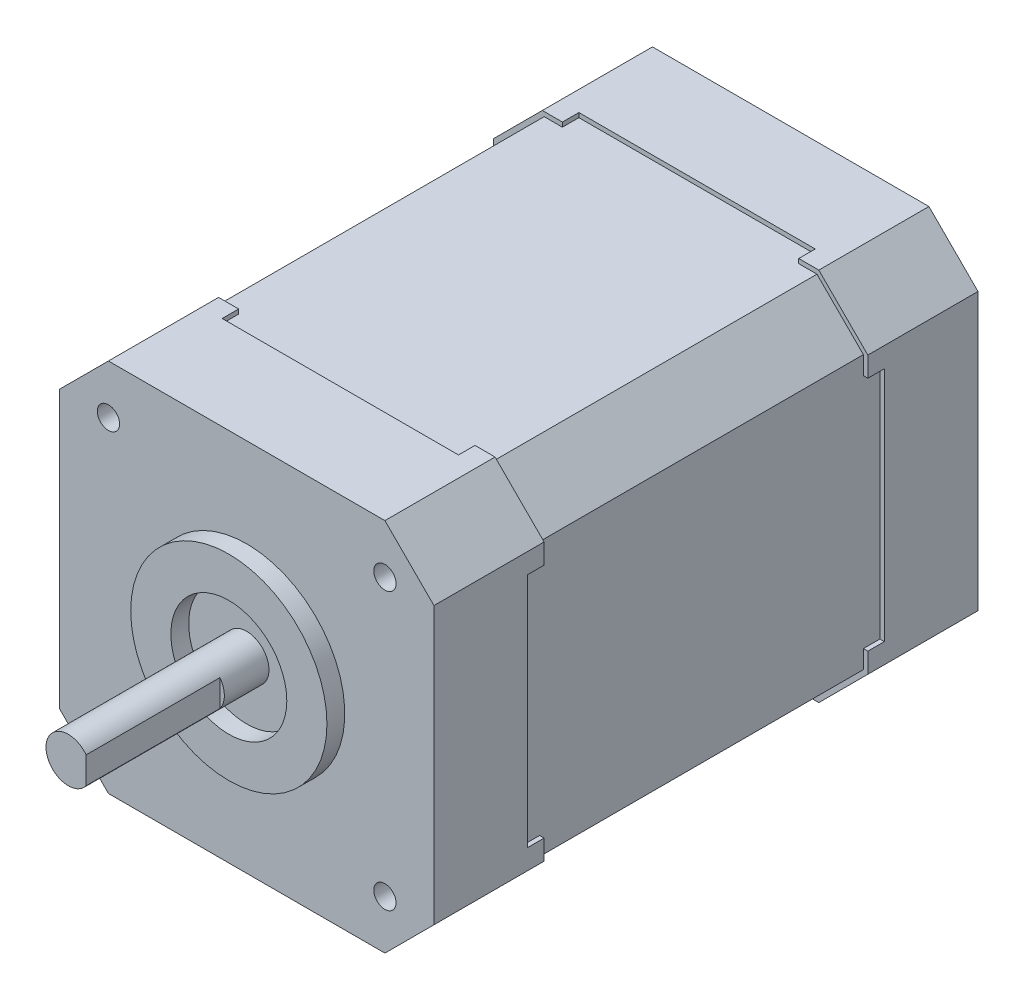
ISO-10303-21;
HEADER;
FILE_DESCRIPTION(('STEP AP214'),'2;1');
FILE_NAME('part.step','',(''),(''),'','','');
FILE_SCHEMA(('AUTOMOTIVE_DESIGN { 1 0 10303 214 1 1 1 1 }'));
ENDSEC;
DATA;
#1=APPLICATION_CONTEXT('core data for automotive mechanical design processes');
#2=APPLICATION_PROTOCOL_DEFINITION('international standard','automotive_design',2000,#1);
#3=PRODUCT_CONTEXT('',#1,'mechanical');
#4=PRODUCT('Part','Part','',(#3));
#5=PRODUCT_RELATED_PRODUCT_CATEGORY('part','',(#4));
#6=PRODUCT_DEFINITION_FORMATION('','',#4);
#7=PRODUCT_DEFINITION_CONTEXT('part definition',#1,'design');
#8=PRODUCT_DEFINITION('design','',#6,#7);
#9=PRODUCT_DEFINITION_SHAPE('','',#8);
#10=(LENGTH_UNIT() NAMED_UNIT(*) SI_UNIT(.MILLI.,.METRE.));
#11=(NAMED_UNIT(*) PLANE_ANGLE_UNIT() SI_UNIT($,.RADIAN.));
#12=(NAMED_UNIT(*) SI_UNIT($,.STERADIAN.) SOLID_ANGLE_UNIT());
#13=UNCERTAINTY_MEASURE_WITH_UNIT(LENGTH_MEASURE(1.E-05),#10,'distance_accuracy_value','');
#14=(GEOMETRIC_REPRESENTATION_CONTEXT(3) GLOBAL_UNCERTAINTY_ASSIGNED_CONTEXT((#13)) GLOBAL_UNIT_ASSIGNED_CONTEXT((#10,
#11,#12)) REPRESENTATION_CONTEXT('',''));
#15=CARTESIAN_POINT('',(0.,0.,0.));
#16=DIRECTION('',(0.,0.,1.));
#17=DIRECTION('',(1.,0.,0.));
#18=AXIS2_PLACEMENT_3D('',#15,#16,#17);
#19=CARTESIAN_POINT('',(21.,21.,-61.));
#20=DIRECTION('',(0.,0.,-1.));
#21=DIRECTION('',(-1.,0.,0.));
#22=AXIS2_PLACEMENT_3D('',#19,#20,#21);
#23=PLANE('',#22);
#24=DIRECTION('',(-1.,0.,0.));
#25=VECTOR('',#24,1.);
#26=CARTESIAN_POINT('',(-15.5,21.,-61.));
#27=LINE('',#26,#25);
#28=CARTESIAN_POINT('',(15.5,21.,-61.));
#29=VERTEX_POINT('',#28);
#30=CARTESIAN_POINT('',(-15.5,21.,-61.));
#31=VERTEX_POINT('',#30);
#32=EDGE_CURVE('E776',#29,#31,#27,.T.);
#33=ORIENTED_EDGE('',*,*,#32,.F.);
#34=DIRECTION('',(-0.707106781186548,0.707106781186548,0.));
#35=VECTOR('',#34,1.);
#36=CARTESIAN_POINT('',(15.5,21.,-61.));
#37=LINE('',#36,#35);
#38=CARTESIAN_POINT('',(21.,15.5,-61.));
#39=VERTEX_POINT('',#38);
#40=EDGE_CURVE('E798',#39,#29,#37,.T.);
#41=ORIENTED_EDGE('',*,*,#40,.F.);
#42=DIRECTION('',(0.,1.,0.));
#43=VECTOR('',#42,1.);
#44=CARTESIAN_POINT('',(21.,15.5,-61.));
#45=LINE('',#44,#43);
#46=CARTESIAN_POINT('',(21.,-15.5,-61.));
#47=VERTEX_POINT('',#46);
#48=EDGE_CURVE('E795',#47,#39,#45,.T.);
#49=ORIENTED_EDGE('',*,*,#48,.F.);
#50=DIRECTION('',(0.707106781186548,0.707106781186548,0.));
#51=VECTOR('',#50,1.);
#52=CARTESIAN_POINT('',(15.5,-21.,-61.));
#53=LINE('',#52,#51);
#54=CARTESIAN_POINT('',(15.5,-21.,-61.));
#55=VERTEX_POINT('',#54);
#56=EDGE_CURVE('E792',#55,#47,#53,.T.);
#57=ORIENTED_EDGE('',*,*,#56,.F.);
#58=DIRECTION('',(1.,0.,0.));
#59=VECTOR('',#58,1.);
#60=CARTESIAN_POINT('',(-15.5,-21.,-61.));
#61=LINE('',#60,#59);
#62=CARTESIAN_POINT('',(-15.5,-21.,-61.));
#63=VERTEX_POINT('',#62);
#64=EDGE_CURVE('E789',#63,#55,#61,.T.);
#65=ORIENTED_EDGE('',*,*,#64,.F.);
#66=DIRECTION('',(0.707106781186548,-0.707106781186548,0.));
#67=VECTOR('',#66,1.);
#68=CARTESIAN_POINT('',(-21.,-15.5,-61.));
#69=LINE('',#68,#67);
#70=CARTESIAN_POINT('',(-21.,-15.5,-61.));
#71=VERTEX_POINT('',#70);
#72=EDGE_CURVE('E786',#71,#63,#69,.T.);
#73=ORIENTED_EDGE('',*,*,#72,.F.);
#74=DIRECTION('',(0.,-1.,0.));
#75=VECTOR('',#74,1.);
#76=CARTESIAN_POINT('',(-21.,15.5,-61.));
#77=LINE('',#76,#75);
#78=CARTESIAN_POINT('',(-21.,15.5,-61.));
#79=VERTEX_POINT('',#78);
#80=EDGE_CURVE('E783',#79,#71,#77,.T.);
#81=ORIENTED_EDGE('',*,*,#80,.F.);
#82=DIRECTION('',(-0.707106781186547,-0.707106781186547,0.));
#83=VECTOR('',#82,1.);
#84=CARTESIAN_POINT('',(-21.,15.5,-61.));
#85=LINE('',#84,#83);
#86=EDGE_CURVE('E779',#31,#79,#85,.T.);
#87=ORIENTED_EDGE('',*,*,#86,.F.);
#88=EDGE_LOOP('',(#33,#41,#49,#57,#65,#73,#81,#87));
#89=FACE_BOUND('',#88,.T.);
#90=CARTESIAN_POINT('',(0.,0.,-61.));
#91=DIRECTION('',(0.,0.,-1.));
#92=DIRECTION('',(-1.,0.,0.));
#93=AXIS2_PLACEMENT_3D('',#90,#91,#92);
#94=CIRCLE('',#93,2.5);
#95=CARTESIAN_POINT('',(-2.5,0.,-61.));
#96=VERTEX_POINT('',#95);
#97=EDGE_CURVE('E435',#96,#96,#94,.T.);
#98=ORIENTED_EDGE('',*,*,#97,.F.);
#99=EDGE_LOOP('',(#98));
#100=FACE_BOUND('',#99,.T.);
#101=ADVANCED_FACE('F41',(#89,#100),#23,.T.);
#102=CARTESIAN_POINT('',(88.0033333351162,21.,-48.65));
#103=DIRECTION('',(0.,0.,1.));
#104=DIRECTION('',(1.,0.,0.));
#105=AXIS2_PLACEMENT_3D('',#102,#103,#104);
#106=PLANE('',#105);
#107=DIRECTION('',(-1.,0.,0.));
#108=VECTOR('',#107,1.);
#109=CARTESIAN_POINT('',(88.0033333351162,13.25,-48.65));
#110=LINE('',#109,#108);
#111=CARTESIAN_POINT('',(-20.5,13.25,-48.65));
#112=VERTEX_POINT('',#111);
#113=CARTESIAN_POINT('',(-21.,13.25,-48.65));
#114=VERTEX_POINT('',#113);
#115=EDGE_CURVE('E486',#112,#114,#110,.T.);
#116=ORIENTED_EDGE('',*,*,#115,.F.);
#117=DIRECTION('',(0.,1.,0.));
#118=VECTOR('',#117,1.);
#119=CARTESIAN_POINT('',(-20.5,-15.2928932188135,-48.65));
#120=LINE('',#119,#118);
#121=CARTESIAN_POINT('',(-20.5,15.2928932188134,-48.65));
#122=VERTEX_POINT('',#121);
#123=EDGE_CURVE('E621',#112,#122,#120,.T.);
#124=ORIENTED_EDGE('',*,*,#123,.T.);
#125=DIRECTION('',(0.707106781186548,0.707106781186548,0.));
#126=VECTOR('',#125,1.);
#127=CARTESIAN_POINT('',(-20.5,15.2928932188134,-48.65));
#128=LINE('',#127,#126);
#129=CARTESIAN_POINT('',(-15.2928932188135,20.5,-48.65));
#130=VERTEX_POINT('',#129);
#131=EDGE_CURVE('E616',#122,#130,#128,.T.);
#132=ORIENTED_EDGE('',*,*,#131,.T.);
#133=DIRECTION('',(-1.,0.,0.));
#134=VECTOR('',#133,1.);
#135=CARTESIAN_POINT('',(88.0033333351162,20.5,-48.65));
#136=LINE('',#135,#134);
#137=CARTESIAN_POINT('',(-13.25,20.5,-48.65));
#138=VERTEX_POINT('',#137);
#139=EDGE_CURVE('E742',#138,#130,#136,.T.);
#140=ORIENTED_EDGE('',*,*,#139,.F.);
#141=DIRECTION('',(0.,-1.,0.));
#142=VECTOR('',#141,1.);
#143=CARTESIAN_POINT('',(-13.25,21.,-48.65));
#144=LINE('',#143,#142);
#145=CARTESIAN_POINT('',(-13.25,21.,-48.65));
#146=VERTEX_POINT('',#145);
#147=EDGE_CURVE('E605',#146,#138,#144,.T.);
#148=ORIENTED_EDGE('',*,*,#147,.F.);
#149=DIRECTION('',(-1.,0.,0.));
#150=VECTOR('',#149,1.);
#151=CARTESIAN_POINT('',(88.0033333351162,21.,-48.65));
#152=LINE('',#151,#150);
#153=CARTESIAN_POINT('',(-15.5,21.,-48.65));
#154=VERTEX_POINT('',#153);
#155=EDGE_CURVE('E730',#146,#154,#152,.T.);
#156=ORIENTED_EDGE('',*,*,#155,.T.);
#157=DIRECTION('',(0.707106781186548,0.707106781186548,0.));
#158=VECTOR('',#157,1.);
#159=CARTESIAN_POINT('',(-21.,15.5,-48.65));
#160=LINE('',#159,#158);
#161=CARTESIAN_POINT('',(-21.,15.5,-48.65));
#162=VERTEX_POINT('',#161);
#163=EDGE_CURVE('E612',#162,#154,#160,.T.);
#164=ORIENTED_EDGE('',*,*,#163,.F.);
#165=DIRECTION('',(0.,1.,0.));
#166=VECTOR('',#165,1.);
#167=CARTESIAN_POINT('',(-21.,-15.5,-48.65));
#168=LINE('',#167,#166);
#169=EDGE_CURVE('E714',#114,#162,#168,.T.);
#170=ORIENTED_EDGE('',*,*,#169,.F.);
#171=EDGE_LOOP('',(#116,#124,#132,#140,#148,#156,#164,#170));
#172=FACE_BOUND('',#171,.T.);
#173=ADVANCED_FACE('F921',(#172),#106,.T.);
#174=CARTESIAN_POINT('',(88.0033333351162,21.,-12.35));
#175=DIRECTION('',(0.,0.,-1.));
#176=DIRECTION('',(-1.,0.,0.));
#177=AXIS2_PLACEMENT_3D('',#174,#175,#176);
#178=PLANE('',#177);
#179=DIRECTION('',(1.,0.,0.));
#180=VECTOR('',#179,1.);
#181=CARTESIAN_POINT('',(88.0033333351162,13.25,-12.35));
#182=LINE('',#181,#180);
#183=CARTESIAN_POINT('',(-21.,13.25,-12.35));
#184=VERTEX_POINT('',#183);
#185=CARTESIAN_POINT('',(-20.5,13.25,-12.35));
#186=VERTEX_POINT('',#185);
#187=EDGE_CURVE('E484',#184,#186,#182,.T.);
#188=ORIENTED_EDGE('',*,*,#187,.F.);
#189=DIRECTION('',(0.,1.,0.));
#190=VECTOR('',#189,1.);
#191=CARTESIAN_POINT('',(-21.,-15.5,-12.35));
#192=LINE('',#191,#190);
#193=CARTESIAN_POINT('',(-21.,15.5,-12.35));
#194=VERTEX_POINT('',#193);
#195=EDGE_CURVE('E710',#184,#194,#192,.T.);
#196=ORIENTED_EDGE('',*,*,#195,.T.);
#197=DIRECTION('',(0.707106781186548,0.707106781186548,0.));
#198=VECTOR('',#197,1.);
#199=CARTESIAN_POINT('',(-21.,15.5,-12.35));
#200=LINE('',#199,#198);
#201=CARTESIAN_POINT('',(-15.5,21.,-12.35));
#202=VERTEX_POINT('',#201);
#203=EDGE_CURVE('E722',#194,#202,#200,.T.);
#204=ORIENTED_EDGE('',*,*,#203,.T.);
#205=DIRECTION('',(-1.,0.,0.));
#206=VECTOR('',#205,1.);
#207=CARTESIAN_POINT('',(88.0033333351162,21.,-12.35));
#208=LINE('',#207,#206);
#209=CARTESIAN_POINT('',(-13.25,21.,-12.35));
#210=VERTEX_POINT('',#209);
#211=EDGE_CURVE('E607',#210,#202,#208,.T.);
#212=ORIENTED_EDGE('',*,*,#211,.F.);
#213=DIRECTION('',(0.,1.,0.));
#214=VECTOR('',#213,1.);
#215=CARTESIAN_POINT('',(-13.25,21.,-12.35));
#216=LINE('',#215,#214);
#217=CARTESIAN_POINT('',(-13.25,20.5,-12.35));
#218=VERTEX_POINT('',#217);
#219=EDGE_CURVE('E603',#218,#210,#216,.T.);
#220=ORIENTED_EDGE('',*,*,#219,.F.);
#221=DIRECTION('',(-1.,0.,0.));
#222=VECTOR('',#221,1.);
#223=CARTESIAN_POINT('',(88.0033333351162,20.5,-12.35));
#224=LINE('',#223,#222);
#225=CARTESIAN_POINT('',(-15.2928932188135,20.5,-12.35));
#226=VERTEX_POINT('',#225);
#227=EDGE_CURVE('E739',#218,#226,#224,.T.);
#228=ORIENTED_EDGE('',*,*,#227,.T.);
#229=DIRECTION('',(0.707106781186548,0.707106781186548,0.));
#230=VECTOR('',#229,1.);
#231=CARTESIAN_POINT('',(-20.5,15.2928932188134,-12.35));
#232=LINE('',#231,#230);
#233=CARTESIAN_POINT('',(-20.5,15.2928932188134,-12.35));
#234=VERTEX_POINT('',#233);
#235=EDGE_CURVE('E719',#234,#226,#232,.T.);
#236=ORIENTED_EDGE('',*,*,#235,.F.);
#237=DIRECTION('',(0.,1.,0.));
#238=VECTOR('',#237,1.);
#239=CARTESIAN_POINT('',(-20.5,-15.2928932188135,-12.35));
#240=LINE('',#239,#238);
#241=EDGE_CURVE('E706',#186,#234,#240,.T.);
#242=ORIENTED_EDGE('',*,*,#241,.F.);
#243=EDGE_LOOP('',(#188,#196,#204,#212,#220,#228,#236,#242));
#244=FACE_BOUND('',#243,.T.);
#245=ADVANCED_FACE('F927',(#244),#178,.T.);
#246=DIRECTION('',(1.,0.,0.));
#247=VECTOR('',#246,1.);
#248=CARTESIAN_POINT('',(88.0033333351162,-13.25,-48.65));
#249=LINE('',#248,#247);
#250=CARTESIAN_POINT('',(-21.,-13.25,-48.65));
#251=VERTEX_POINT('',#250);
#252=CARTESIAN_POINT('',(-20.5,-13.25,-48.65));
#253=VERTEX_POINT('',#252);
#254=EDGE_CURVE('E482',#251,#253,#249,.T.);
#255=ORIENTED_EDGE('',*,*,#254,.F.);
#256=CARTESIAN_POINT('',(-21.,-15.5,-48.65));
#257=VERTEX_POINT('',#256);
#258=EDGE_CURVE('E617',#257,#251,#168,.T.);
#259=ORIENTED_EDGE('',*,*,#258,.F.);
#260=DIRECTION('',(-0.707106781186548,0.707106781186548,0.));
#261=VECTOR('',#260,1.);
#262=CARTESIAN_POINT('',(-15.5,-21.,-48.65));
#263=LINE('',#262,#261);
#264=CARTESIAN_POINT('',(-15.5,-21.,-48.65));
#265=VERTEX_POINT('',#264);
#266=EDGE_CURVE('E698',#265,#257,#263,.T.);
#267=ORIENTED_EDGE('',*,*,#266,.F.);
#268=DIRECTION('',(-1.,0.,0.));
#269=VECTOR('',#268,1.);
#270=CARTESIAN_POINT('',(15.5,-21.,-48.65));
#271=LINE('',#270,#269);
#272=CARTESIAN_POINT('',(-13.25,-21.,-48.65));
#273=VERTEX_POINT('',#272);
#274=EDGE_CURVE('E687',#273,#265,#271,.T.);
#275=ORIENTED_EDGE('',*,*,#274,.F.);
#276=DIRECTION('',(0.,-1.,0.));
#277=VECTOR('',#276,1.);
#278=CARTESIAN_POINT('',(-13.25,21.,-48.65));
#279=LINE('',#278,#277);
#280=CARTESIAN_POINT('',(-13.25,-20.5,-48.65));
#281=VERTEX_POINT('',#280);
#282=EDGE_CURVE('E525',#281,#273,#279,.T.);
#283=ORIENTED_EDGE('',*,*,#282,.F.);
#284=DIRECTION('',(-1.,0.,0.));
#285=VECTOR('',#284,1.);
#286=CARTESIAN_POINT('',(15.2928932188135,-20.5,-48.65));
#287=LINE('',#286,#285);
#288=CARTESIAN_POINT('',(-15.2928932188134,-20.5,-48.65));
#289=VERTEX_POINT('',#288);
#290=EDGE_CURVE('E691',#281,#289,#287,.T.);
#291=ORIENTED_EDGE('',*,*,#290,.T.);
#292=DIRECTION('',(-0.707106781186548,0.707106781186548,0.));
#293=VECTOR('',#292,1.);
#294=CARTESIAN_POINT('',(-15.2928932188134,-20.5,-48.65));
#295=LINE('',#294,#293);
#296=CARTESIAN_POINT('',(-20.5,-15.2928932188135,-48.65));
#297=VERTEX_POINT('',#296);
#298=EDGE_CURVE('E622',#289,#297,#295,.T.);
#299=ORIENTED_EDGE('',*,*,#298,.T.);
#300=EDGE_CURVE('E703',#297,#253,#120,.T.);
#301=ORIENTED_EDGE('',*,*,#300,.T.);
#302=EDGE_LOOP('',(#255,#259,#267,#275,#283,#291,#299,#301));
#303=FACE_BOUND('',#302,.T.);
#304=ADVANCED_FACE('F930',(#303),#106,.T.);
#305=DIRECTION('',(-1.,0.,0.));
#306=VECTOR('',#305,1.);
#307=CARTESIAN_POINT('',(88.0033333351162,-13.25,-12.35));
#308=LINE('',#307,#306);
#309=CARTESIAN_POINT('',(-20.5,-13.25,-12.35));
#310=VERTEX_POINT('',#309);
#311=CARTESIAN_POINT('',(-21.,-13.25,-12.35));
#312=VERTEX_POINT('',#311);
#313=EDGE_CURVE('E56',#310,#312,#308,.T.);
#314=ORIENTED_EDGE('',*,*,#313,.F.);
#315=CARTESIAN_POINT('',(-20.5,-15.2928932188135,-12.35));
#316=VERTEX_POINT('',#315);
#317=EDGE_CURVE('E707',#316,#310,#240,.T.);
#318=ORIENTED_EDGE('',*,*,#317,.F.);
#319=DIRECTION('',(-0.707106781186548,0.707106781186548,0.));
#320=VECTOR('',#319,1.);
#321=CARTESIAN_POINT('',(-15.2928932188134,-20.5,-12.35));
#322=LINE('',#321,#320);
#323=CARTESIAN_POINT('',(-15.2928932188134,-20.5,-12.35));
#324=VERTEX_POINT('',#323);
#325=EDGE_CURVE('E626',#324,#316,#322,.T.);
#326=ORIENTED_EDGE('',*,*,#325,.F.);
#327=DIRECTION('',(-1.,0.,0.));
#328=VECTOR('',#327,1.);
#329=CARTESIAN_POINT('',(15.2928932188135,-20.5,-12.35));
#330=LINE('',#329,#328);
#331=CARTESIAN_POINT('',(-13.25,-20.5,-12.35));
#332=VERTEX_POINT('',#331);
#333=EDGE_CURVE('E679',#332,#324,#330,.T.);
#334=ORIENTED_EDGE('',*,*,#333,.F.);
#335=DIRECTION('',(0.,1.,0.));
#336=VECTOR('',#335,1.);
#337=CARTESIAN_POINT('',(-13.25,21.,-12.35));
#338=LINE('',#337,#336);
#339=CARTESIAN_POINT('',(-13.25,-21.,-12.35));
#340=VERTEX_POINT('',#339);
#341=EDGE_CURVE('E522',#340,#332,#338,.T.);
#342=ORIENTED_EDGE('',*,*,#341,.F.);
#343=DIRECTION('',(-1.,0.,0.));
#344=VECTOR('',#343,1.);
#345=CARTESIAN_POINT('',(15.5,-21.,-12.35));
#346=LINE('',#345,#344);
#347=CARTESIAN_POINT('',(-15.5,-21.,-12.35));
#348=VERTEX_POINT('',#347);
#349=EDGE_CURVE('E683',#340,#348,#346,.T.);
#350=ORIENTED_EDGE('',*,*,#349,.T.);
#351=DIRECTION('',(-0.707106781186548,0.707106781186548,0.));
#352=VECTOR('',#351,1.);
#353=CARTESIAN_POINT('',(-15.5,-21.,-12.35));
#354=LINE('',#353,#352);
#355=CARTESIAN_POINT('',(-21.,-15.5,-12.35));
#356=VERTEX_POINT('',#355);
#357=EDGE_CURVE('E696',#348,#356,#354,.T.);
#358=ORIENTED_EDGE('',*,*,#357,.T.);
#359=EDGE_CURVE('E711',#356,#312,#192,.T.);
#360=ORIENTED_EDGE('',*,*,#359,.T.);
#361=EDGE_LOOP('',(#314,#318,#326,#334,#342,#350,#358,#360));
#362=FACE_BOUND('',#361,.T.);
#363=ADVANCED_FACE('F995',(#362),#178,.T.);
#364=DIRECTION('',(-1.,0.,0.));
#365=VECTOR('',#364,1.);
#366=CARTESIAN_POINT('',(88.0033333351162,13.25,-48.65));
#367=LINE('',#366,#365);
#368=CARTESIAN_POINT('',(21.,13.25,-48.65));
#369=VERTEX_POINT('',#368);
#370=CARTESIAN_POINT('',(20.5,13.25,-48.65));
#371=VERTEX_POINT('',#370);
#372=EDGE_CURVE('E565',#369,#371,#367,.T.);
#373=ORIENTED_EDGE('',*,*,#372,.F.);
#374=DIRECTION('',(0.,-1.,0.));
#375=VECTOR('',#374,1.);
#376=CARTESIAN_POINT('',(21.,15.5,-48.65));
#377=LINE('',#376,#375);
#378=CARTESIAN_POINT('',(21.,15.5,-48.65));
#379=VERTEX_POINT('',#378);
#380=EDGE_CURVE('E651',#379,#369,#377,.T.);
#381=ORIENTED_EDGE('',*,*,#380,.F.);
#382=DIRECTION('',(0.707106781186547,-0.707106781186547,0.));
#383=VECTOR('',#382,1.);
#384=CARTESIAN_POINT('',(15.5,21.,-48.65));
#385=LINE('',#384,#383);
#386=CARTESIAN_POINT('',(15.5,21.,-48.65));
#387=VERTEX_POINT('',#386);
#388=EDGE_CURVE('E636',#387,#379,#385,.T.);
#389=ORIENTED_EDGE('',*,*,#388,.F.);
#390=CARTESIAN_POINT('',(13.25,21.,-48.65));
#391=VERTEX_POINT('',#390);
#392=EDGE_CURVE('E733',#387,#391,#152,.T.);
#393=ORIENTED_EDGE('',*,*,#392,.T.);
#394=DIRECTION('',(0.,1.,0.));
#395=VECTOR('',#394,1.);
#396=CARTESIAN_POINT('',(13.25,21.,-48.65));
#397=LINE('',#396,#395);
#398=CARTESIAN_POINT('',(13.25,20.5,-48.65));
#399=VERTEX_POINT('',#398);
#400=EDGE_CURVE('E601',#399,#391,#397,.T.);
#401=ORIENTED_EDGE('',*,*,#400,.F.);
#402=CARTESIAN_POINT('',(15.2928932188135,20.5,-48.65));
#403=VERTEX_POINT('',#402);
#404=EDGE_CURVE('E745',#403,#399,#136,.T.);
#405=ORIENTED_EDGE('',*,*,#404,.F.);
#406=DIRECTION('',(0.707106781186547,-0.707106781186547,0.));
#407=VECTOR('',#406,1.);
#408=CARTESIAN_POINT('',(15.2928932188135,20.5,-48.65));
#409=LINE('',#408,#407);
#410=CARTESIAN_POINT('',(20.5,15.2928932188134,-48.65));
#411=VERTEX_POINT('',#410);
#412=EDGE_CURVE('E640',#403,#411,#409,.T.);
#413=ORIENTED_EDGE('',*,*,#412,.T.);
#414=DIRECTION('',(0.,-1.,0.));
#415=VECTOR('',#414,1.);
#416=CARTESIAN_POINT('',(20.5,15.2928932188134,-48.65));
#417=LINE('',#416,#415);
#418=EDGE_CURVE('E655',#411,#371,#417,.T.);
#419=ORIENTED_EDGE('',*,*,#418,.T.);
#420=EDGE_LOOP('',(#373,#381,#389,#393,#401,#405,#413,#419));
#421=FACE_BOUND('',#420,.T.);
#422=ADVANCED_FACE('F886',(#421),#106,.T.);
#423=DIRECTION('',(1.,0.,0.));
#424=VECTOR('',#423,1.);
#425=CARTESIAN_POINT('',(88.0033333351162,13.25,-12.35));
#426=LINE('',#425,#424);
#427=CARTESIAN_POINT('',(20.5,13.25,-12.35));
#428=VERTEX_POINT('',#427);
#429=CARTESIAN_POINT('',(21.,13.25,-12.35));
#430=VERTEX_POINT('',#429);
#431=EDGE_CURVE('E563',#428,#430,#426,.T.);
#432=ORIENTED_EDGE('',*,*,#431,.F.);
#433=DIRECTION('',(0.,-1.,0.));
#434=VECTOR('',#433,1.);
#435=CARTESIAN_POINT('',(20.5,15.2928932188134,-12.35));
#436=LINE('',#435,#434);
#437=CARTESIAN_POINT('',(20.5,15.2928932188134,-12.35));
#438=VERTEX_POINT('',#437);
#439=EDGE_CURVE('E659',#438,#428,#436,.T.);
#440=ORIENTED_EDGE('',*,*,#439,.F.);
#441=DIRECTION('',(0.707106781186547,-0.707106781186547,0.));
#442=VECTOR('',#441,1.);
#443=CARTESIAN_POINT('',(15.2928932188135,20.5,-12.35));
#444=LINE('',#443,#442);
#445=CARTESIAN_POINT('',(15.2928932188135,20.5,-12.35));
#446=VERTEX_POINT('',#445);
#447=EDGE_CURVE('E643',#446,#438,#444,.T.);
#448=ORIENTED_EDGE('',*,*,#447,.F.);
#449=CARTESIAN_POINT('',(13.25,20.5,-12.35));
#450=VERTEX_POINT('',#449);
#451=EDGE_CURVE('E637',#446,#450,#224,.T.);
#452=ORIENTED_EDGE('',*,*,#451,.T.);
#453=DIRECTION('',(0.,-1.,0.));
#454=VECTOR('',#453,1.);
#455=CARTESIAN_POINT('',(13.25,21.,-12.35));
#456=LINE('',#455,#454);
#457=CARTESIAN_POINT('',(13.25,21.,-12.35));
#458=VERTEX_POINT('',#457);
#459=EDGE_CURVE('E598',#458,#450,#456,.T.);
#460=ORIENTED_EDGE('',*,*,#459,.F.);
#461=CARTESIAN_POINT('',(15.5,21.,-12.35));
#462=VERTEX_POINT('',#461);
#463=EDGE_CURVE('E727',#462,#458,#208,.T.);
#464=ORIENTED_EDGE('',*,*,#463,.F.);
#465=DIRECTION('',(0.707106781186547,-0.707106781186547,0.));
#466=VECTOR('',#465,1.);
#467=CARTESIAN_POINT('',(15.5,21.,-12.35));
#468=LINE('',#467,#466);
#469=CARTESIAN_POINT('',(21.,15.5,-12.35));
#470=VERTEX_POINT('',#469);
#471=EDGE_CURVE('E632',#462,#470,#468,.T.);
#472=ORIENTED_EDGE('',*,*,#471,.T.);
#473=DIRECTION('',(0.,-1.,0.));
#474=VECTOR('',#473,1.);
#475=CARTESIAN_POINT('',(21.,15.5,-12.35));
#476=LINE('',#475,#474);
#477=EDGE_CURVE('E647',#470,#430,#476,.T.);
#478=ORIENTED_EDGE('',*,*,#477,.T.);
#479=EDGE_LOOP('',(#432,#440,#448,#452,#460,#464,#472,#478));
#480=FACE_BOUND('',#479,.T.);
#481=ADVANCED_FACE('F987',(#480),#178,.T.);
#482=CARTESIAN_POINT('',(-15.5,21.,-61.));
#483=DIRECTION('',(0.,1.,0.));
#484=DIRECTION('',(0.,0.,1.));
#485=AXIS2_PLACEMENT_3D('',#482,#483,#484);
#486=PLANE('',#485);
#487=DIRECTION('',(0.,0.,1.));
#488=VECTOR('',#487,1.);
#489=CARTESIAN_POINT('',(-13.25,21.,-50.5));
#490=LINE('',#489,#488);
#491=CARTESIAN_POINT('',(-13.25,21.,-10.5));
#492=VERTEX_POINT('',#491);
#493=EDGE_CURVE('E567',#210,#492,#490,.T.);
#494=ORIENTED_EDGE('',*,*,#493,.F.);
#495=ORIENTED_EDGE('',*,*,#211,.T.);
#496=DIRECTION('',(0.,0.,1.));
#497=VECTOR('',#496,1.);
#498=CARTESIAN_POINT('',(-15.5,21.,-61.));
#499=LINE('',#498,#497);
#500=CARTESIAN_POINT('',(-15.5,21.,0.));
#501=VERTEX_POINT('',#500);
#502=EDGE_CURVE('E801',#202,#501,#499,.T.);
#503=ORIENTED_EDGE('',*,*,#502,.T.);
#504=DIRECTION('',(-1.,0.,0.));
#505=VECTOR('',#504,1.);
#506=CARTESIAN_POINT('',(-15.5,21.,0.));
#507=LINE('',#506,#505);
#508=CARTESIAN_POINT('',(15.5,21.,0.));
#509=VERTEX_POINT('',#508);
#510=EDGE_CURVE('E775',#509,#501,#507,.T.);
#511=ORIENTED_EDGE('',*,*,#510,.F.);
#512=DIRECTION('',(0.,0.,1.));
#513=VECTOR('',#512,1.);
#514=CARTESIAN_POINT('',(15.5,21.,-61.));
#515=LINE('',#514,#513);
#516=EDGE_CURVE('E828',#462,#509,#515,.T.);
#517=ORIENTED_EDGE('',*,*,#516,.F.);
#518=ORIENTED_EDGE('',*,*,#463,.T.);
#519=DIRECTION('',(0.,0.,-1.));
#520=VECTOR('',#519,1.);
#521=CARTESIAN_POINT('',(13.25,21.,-50.5));
#522=LINE('',#521,#520);
#523=CARTESIAN_POINT('',(13.25,21.,-10.5));
#524=VERTEX_POINT('',#523);
#525=EDGE_CURVE('E582',#524,#458,#522,.T.);
#526=ORIENTED_EDGE('',*,*,#525,.F.);
#527=DIRECTION('',(1.,0.,0.));
#528=VECTOR('',#527,1.);
#529=CARTESIAN_POINT('',(-13.25,21.,-10.5));
#530=LINE('',#529,#528);
#531=EDGE_CURVE('E579',#492,#524,#530,.T.);
#532=ORIENTED_EDGE('',*,*,#531,.F.);
#533=EDGE_LOOP('',(#494,#495,#503,#511,#517,#518,#526,#532));
#534=FACE_BOUND('',#533,.T.);
#535=ADVANCED_FACE('F979',(#534),#486,.T.);
#536=CARTESIAN_POINT('',(15.5,21.,-61.));
#537=DIRECTION('',(0.707106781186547,0.707106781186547,0.));
#538=DIRECTION('',(-0.707106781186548,0.707106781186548,0.));
#539=AXIS2_PLACEMENT_3D('',#536,#537,#538);
#540=PLANE('',#539);
#541=DIRECTION('',(0.,0.,1.));
#542=VECTOR('',#541,1.);
#543=CARTESIAN_POINT('',(21.,15.5,-61.));
#544=LINE('',#543,#542);
#545=CARTESIAN_POINT('',(21.,15.5,0.));
#546=VERTEX_POINT('',#545);
#547=EDGE_CURVE('E832',#470,#546,#544,.T.);
#548=ORIENTED_EDGE('',*,*,#547,.F.);
#549=ORIENTED_EDGE('',*,*,#471,.F.);
#550=ORIENTED_EDGE('',*,*,#516,.T.);
#551=DIRECTION('',(-0.707106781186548,0.707106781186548,0.));
#552=VECTOR('',#551,1.);
#553=CARTESIAN_POINT('',(15.5,21.,0.));
#554=LINE('',#553,#552);
#555=EDGE_CURVE('E780',#546,#509,#554,.T.);
#556=ORIENTED_EDGE('',*,*,#555,.F.);
#557=EDGE_LOOP('',(#548,#549,#550,#556));
#558=FACE_BOUND('',#557,.T.);
#559=ADVANCED_FACE('F949',(#558),#540,.T.);
#560=CARTESIAN_POINT('',(21.,15.5,-61.));
#561=DIRECTION('',(1.,0.,0.));
#562=DIRECTION('',(0.,1.,0.));
#563=AXIS2_PLACEMENT_3D('',#560,#561,#562);
#564=PLANE('',#563);
#565=DIRECTION('',(0.,0.,1.));
#566=VECTOR('',#565,1.);
#567=CARTESIAN_POINT('',(21.,13.25,-10.5));
#568=LINE('',#567,#566);
#569=CARTESIAN_POINT('',(21.,13.25,-10.5));
#570=VERTEX_POINT('',#569);
#571=EDGE_CURVE('E544',#430,#570,#568,.T.);
#572=ORIENTED_EDGE('',*,*,#571,.F.);
#573=ORIENTED_EDGE('',*,*,#477,.F.);
#574=ORIENTED_EDGE('',*,*,#547,.T.);
#575=DIRECTION('',(0.,1.,0.));
#576=VECTOR('',#575,1.);
#577=CARTESIAN_POINT('',(21.,15.5,0.));
#578=LINE('',#577,#576);
#579=CARTESIAN_POINT('',(21.,-15.5,0.));
#580=VERTEX_POINT('',#579);
#581=EDGE_CURVE('E819',#580,#546,#578,.T.);
#582=ORIENTED_EDGE('',*,*,#581,.F.);
#583=DIRECTION('',(0.,0.,1.));
#584=VECTOR('',#583,1.);
#585=CARTESIAN_POINT('',(21.,-15.5,-61.));
#586=LINE('',#585,#584);
#587=CARTESIAN_POINT('',(21.,-15.5,-12.35));
#588=VERTEX_POINT('',#587);
#589=EDGE_CURVE('E836',#588,#580,#586,.T.);
#590=ORIENTED_EDGE('',*,*,#589,.F.);
#591=CARTESIAN_POINT('',(21.,-13.25,-12.35));
#592=VERTEX_POINT('',#591);
#593=EDGE_CURVE('E631',#592,#588,#476,.T.);
#594=ORIENTED_EDGE('',*,*,#593,.F.);
#595=DIRECTION('',(0.,0.,-1.));
#596=VECTOR('',#595,1.);
#597=CARTESIAN_POINT('',(21.,-13.25,-10.5));
#598=LINE('',#597,#596);
#599=CARTESIAN_POINT('',(21.,-13.25,-10.5));
#600=VERTEX_POINT('',#599);
#601=EDGE_CURVE('E539',#600,#592,#598,.T.);
#602=ORIENTED_EDGE('',*,*,#601,.F.);
#603=DIRECTION('',(0.,-1.,0.));
#604=VECTOR('',#603,1.);
#605=CARTESIAN_POINT('',(21.,13.25,-10.5));
#606=LINE('',#605,#604);
#607=EDGE_CURVE('E527',#570,#600,#606,.T.);
#608=ORIENTED_EDGE('',*,*,#607,.F.);
#609=EDGE_LOOP('',(#572,#573,#574,#582,#590,#594,#602,#608));
#610=FACE_BOUND('',#609,.T.);
#611=ADVANCED_FACE('F954',(#610),#564,.T.);
#612=CARTESIAN_POINT('',(15.5,-21.,-61.));
#613=DIRECTION('',(0.707106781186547,-0.707106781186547,0.));
#614=DIRECTION('',(0.707106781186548,0.707106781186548,0.));
#615=AXIS2_PLACEMENT_3D('',#612,#613,#614);
#616=PLANE('',#615);
#617=DIRECTION('',(0.,0.,1.));
#618=VECTOR('',#617,1.);
#619=CARTESIAN_POINT('',(15.5,-21.,-61.));
#620=LINE('',#619,#618);
#621=CARTESIAN_POINT('',(15.5,-21.,-12.35));
#622=VERTEX_POINT('',#621);
#623=CARTESIAN_POINT('',(15.5,-21.,0.));
#624=VERTEX_POINT('',#623);
#625=EDGE_CURVE('E840',#622,#624,#620,.T.);
#626=ORIENTED_EDGE('',*,*,#625,.F.);
#627=DIRECTION('',(-0.707106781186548,-0.707106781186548,0.));
#628=VECTOR('',#627,1.);
#629=CARTESIAN_POINT('',(21.,-15.5,-12.35));
#630=LINE('',#629,#628);
#631=EDGE_CURVE('E665',#588,#622,#630,.T.);
#632=ORIENTED_EDGE('',*,*,#631,.F.);
#633=ORIENTED_EDGE('',*,*,#589,.T.);
#634=DIRECTION('',(0.707106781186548,0.707106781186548,0.));
#635=VECTOR('',#634,1.);
#636=CARTESIAN_POINT('',(15.5,-21.,0.));
#637=LINE('',#636,#635);
#638=EDGE_CURVE('E816',#624,#580,#637,.T.);
#639=ORIENTED_EDGE('',*,*,#638,.F.);
#640=EDGE_LOOP('',(#626,#632,#633,#639));
#641=FACE_BOUND('',#640,.T.);
#642=ADVANCED_FACE('F959',(#641),#616,.T.);
#643=CARTESIAN_POINT('',(-15.5,-21.,-61.));
#644=DIRECTION('',(0.,-1.,0.));
#645=DIRECTION('',(1.,0.,0.));
#646=AXIS2_PLACEMENT_3D('',#643,#644,#645);
#647=PLANE('',#646);
#648=DIRECTION('',(0.,0.,-1.));
#649=VECTOR('',#648,1.);
#650=CARTESIAN_POINT('',(-13.25,-21.,-10.5));
#651=LINE('',#650,#649);
#652=CARTESIAN_POINT('',(-13.25,-21.,-10.5));
#653=VERTEX_POINT('',#652);
#654=EDGE_CURVE('E488',#653,#340,#651,.T.);
#655=ORIENTED_EDGE('',*,*,#654,.F.);
#656=DIRECTION('',(-1.,0.,0.));
#657=VECTOR('',#656,1.);
#658=CARTESIAN_POINT('',(-13.25,-21.,-10.5));
#659=LINE('',#658,#657);
#660=CARTESIAN_POINT('',(13.25,-21.,-10.5));
#661=VERTEX_POINT('',#660);
#662=EDGE_CURVE('E505',#661,#653,#659,.T.);
#663=ORIENTED_EDGE('',*,*,#662,.F.);
#664=DIRECTION('',(0.,0.,1.));
#665=VECTOR('',#664,1.);
#666=CARTESIAN_POINT('',(13.25,-21.,-10.5));
#667=LINE('',#666,#665);
#668=CARTESIAN_POINT('',(13.25,-21.,-12.35));
#669=VERTEX_POINT('',#668);
#670=EDGE_CURVE('E502',#669,#661,#667,.T.);
#671=ORIENTED_EDGE('',*,*,#670,.F.);
#672=EDGE_CURVE('E684',#622,#669,#346,.T.);
#673=ORIENTED_EDGE('',*,*,#672,.F.);
#674=ORIENTED_EDGE('',*,*,#625,.T.);
#675=DIRECTION('',(1.,0.,0.));
#676=VECTOR('',#675,1.);
#677=CARTESIAN_POINT('',(-15.5,-21.,0.));
#678=LINE('',#677,#676);
#679=CARTESIAN_POINT('',(-15.5,-21.,0.));
#680=VERTEX_POINT('',#679);
#681=EDGE_CURVE('E813',#680,#624,#678,.T.);
#682=ORIENTED_EDGE('',*,*,#681,.F.);
#683=DIRECTION('',(0.,0.,1.));
#684=VECTOR('',#683,1.);
#685=CARTESIAN_POINT('',(-15.5,-21.,-61.));
#686=LINE('',#685,#684);
#687=EDGE_CURVE('E844',#348,#680,#686,.T.);
#688=ORIENTED_EDGE('',*,*,#687,.F.);
#689=ORIENTED_EDGE('',*,*,#349,.F.);
#690=EDGE_LOOP('',(#655,#663,#671,#673,#674,#682,#688,#689));
#691=FACE_BOUND('',#690,.T.);
#692=ADVANCED_FACE('F964',(#691),#647,.T.);
#693=CARTESIAN_POINT('',(-21.,-15.5,-61.));
#694=DIRECTION('',(-0.707106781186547,-0.707106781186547,0.));
#695=DIRECTION('',(0.707106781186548,-0.707106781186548,0.));
#696=AXIS2_PLACEMENT_3D('',#693,#694,#695);
#697=PLANE('',#696);
#698=DIRECTION('',(0.,0.,1.));
#699=VECTOR('',#698,1.);
#700=CARTESIAN_POINT('',(-21.,-15.5,-61.));
#701=LINE('',#700,#699);
#702=CARTESIAN_POINT('',(-21.,-15.5,0.));
#703=VERTEX_POINT('',#702);
#704=EDGE_CURVE('E848',#356,#703,#701,.T.);
#705=ORIENTED_EDGE('',*,*,#704,.F.);
#706=ORIENTED_EDGE('',*,*,#357,.F.);
#707=ORIENTED_EDGE('',*,*,#687,.T.);
#708=DIRECTION('',(0.707106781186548,-0.707106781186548,0.));
#709=VECTOR('',#708,1.);
#710=CARTESIAN_POINT('',(-21.,-15.5,0.));
#711=LINE('',#710,#709);
#712=EDGE_CURVE('E810',#703,#680,#711,.T.);
#713=ORIENTED_EDGE('',*,*,#712,.F.);
#714=EDGE_LOOP('',(#705,#706,#707,#713));
#715=FACE_BOUND('',#714,.T.);
#716=ADVANCED_FACE('F969',(#715),#697,.T.);
#717=CARTESIAN_POINT('',(-21.,15.5,-61.));
#718=DIRECTION('',(-1.,0.,0.));
#719=DIRECTION('',(0.,-1.,0.));
#720=AXIS2_PLACEMENT_3D('',#717,#718,#719);
#721=PLANE('',#720);
#722=DIRECTION('',(0.,0.,-1.));
#723=VECTOR('',#722,1.);
#724=CARTESIAN_POINT('',(-21.,13.25,-50.5));
#725=LINE('',#724,#723);
#726=CARTESIAN_POINT('',(-21.,13.25,-10.5));
#727=VERTEX_POINT('',#726);
#728=EDGE_CURVE('E469',#727,#184,#725,.T.);
#729=ORIENTED_EDGE('',*,*,#728,.F.);
#730=DIRECTION('',(0.,1.,0.));
#731=VECTOR('',#730,1.);
#732=CARTESIAN_POINT('',(-21.,13.25,-10.5));
#733=LINE('',#732,#731);
#734=CARTESIAN_POINT('',(-21.,-13.25,-10.5));
#735=VERTEX_POINT('',#734);
#736=EDGE_CURVE('E466',#735,#727,#733,.T.);
#737=ORIENTED_EDGE('',*,*,#736,.F.);
#738=DIRECTION('',(0.,0.,1.));
#739=VECTOR('',#738,1.);
#740=CARTESIAN_POINT('',(-21.,-13.25,-50.5));
#741=LINE('',#740,#739);
#742=EDGE_CURVE('E463',#312,#735,#741,.T.);
#743=ORIENTED_EDGE('',*,*,#742,.F.);
#744=ORIENTED_EDGE('',*,*,#359,.F.);
#745=ORIENTED_EDGE('',*,*,#704,.T.);
#746=DIRECTION('',(0.,-1.,0.));
#747=VECTOR('',#746,1.);
#748=CARTESIAN_POINT('',(-21.,15.5,0.));
#749=LINE('',#748,#747);
#750=CARTESIAN_POINT('',(-21.,15.5,0.));
#751=VERTEX_POINT('',#750);
#752=EDGE_CURVE('E807',#751,#703,#749,.T.);
#753=ORIENTED_EDGE('',*,*,#752,.F.);
#754=DIRECTION('',(0.,0.,1.));
#755=VECTOR('',#754,1.);
#756=CARTESIAN_POINT('',(-21.,15.5,-61.));
#757=LINE('',#756,#755);
#758=EDGE_CURVE('E852',#194,#751,#757,.T.);
#759=ORIENTED_EDGE('',*,*,#758,.F.);
#760=ORIENTED_EDGE('',*,*,#195,.F.);
#761=EDGE_LOOP('',(#729,#737,#743,#744,#745,#753,#759,#760));
#762=FACE_BOUND('',#761,.T.);
#763=ADVANCED_FACE('F974',(#762),#721,.T.);
#764=CARTESIAN_POINT('',(-21.,15.5,-61.));
#765=DIRECTION('',(-0.707106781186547,0.707106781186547,0.));
#766=DIRECTION('',(-0.707106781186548,-0.707106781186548,0.));
#767=AXIS2_PLACEMENT_3D('',#764,#765,#766);
#768=PLANE('',#767);
#769=ORIENTED_EDGE('',*,*,#502,.F.);
#770=ORIENTED_EDGE('',*,*,#203,.F.);
#771=ORIENTED_EDGE('',*,*,#758,.T.);
#772=DIRECTION('',(-0.707106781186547,-0.707106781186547,0.));
#773=VECTOR('',#772,1.);
#774=CARTESIAN_POINT('',(-21.,15.5,0.));
#775=LINE('',#774,#773);
#776=EDGE_CURVE('E804',#501,#751,#775,.T.);
#777=ORIENTED_EDGE('',*,*,#776,.F.);
#778=EDGE_LOOP('',(#769,#770,#771,#777));
#779=FACE_BOUND('',#778,.T.);
#780=ADVANCED_FACE('F942',(#779),#768,.T.);
#781=CARTESIAN_POINT('',(21.,21.,0.));
#782=DIRECTION('',(0.,0.,-1.));
#783=DIRECTION('',(-1.,0.,0.));
#784=AXIS2_PLACEMENT_3D('',#781,#782,#783);
#785=PLANE('',#784);
#786=CARTESIAN_POINT('',(0.,0.,0.));
#787=DIRECTION('',(0.,0.,1.));
#788=DIRECTION('',(1.,0.,0.));
#789=AXIS2_PLACEMENT_3D('',#786,#787,#788);
#790=CIRCLE('',#789,6.5);
#791=CARTESIAN_POINT('',(6.5,0.,0.));
#792=VERTEX_POINT('',#791);
#793=EDGE_CURVE('E766',#792,#792,#790,.T.);
#794=ORIENTED_EDGE('',*,*,#793,.T.);
#795=EDGE_LOOP('',(#794));
#796=FACE_BOUND('',#795,.T.);
#797=CARTESIAN_POINT('',(0.,0.,0.));
#798=DIRECTION('',(0.,0.,-1.));
#799=DIRECTION('',(-1.,0.,0.));
#800=AXIS2_PLACEMENT_3D('',#797,#798,#799);
#801=CIRCLE('',#800,2.5);
#802=CARTESIAN_POINT('',(-2.5,0.,0.));
#803=VERTEX_POINT('',#802);
#804=EDGE_CURVE('E858',#803,#803,#801,.F.);
#805=ORIENTED_EDGE('',*,*,#804,.F.);
#806=EDGE_LOOP('',(#805));
#807=FACE_BOUND('',#806,.T.);
#808=ADVANCED_FACE('F938',(#796,#807),#785,.F.);
#809=CARTESIAN_POINT('',(-15.5,15.5,0.));
#810=DIRECTION('',(0.,0.,1.));
#811=DIRECTION('',(1.,0.,0.));
#812=AXIS2_PLACEMENT_3D('',#809,#810,#811);
#813=CIRCLE('',#812,1.25);
#814=CARTESIAN_POINT('',(-14.25,15.5,0.));
#815=VERTEX_POINT('',#814);
#816=EDGE_CURVE('E429',#815,#815,#813,.T.);
#817=ORIENTED_EDGE('',*,*,#816,.F.);
#818=EDGE_LOOP('',(#817));
#819=FACE_BOUND('',#818,.T.);
#820=CARTESIAN_POINT('',(15.5,15.5,0.));
#821=DIRECTION('',(0.,0.,1.));
#822=DIRECTION('',(1.,0.,0.));
#823=AXIS2_PLACEMENT_3D('',#820,#821,#822);
#824=CIRCLE('',#823,1.25);
#825=CARTESIAN_POINT('',(16.75,15.5,0.));
#826=VERTEX_POINT('',#825);
#827=EDGE_CURVE('E428',#826,#826,#824,.T.);
#828=ORIENTED_EDGE('',*,*,#827,.F.);
#829=EDGE_LOOP('',(#828));
#830=FACE_BOUND('',#829,.T.);
#831=CARTESIAN_POINT('',(15.5,-15.5,0.));
#832=DIRECTION('',(0.,0.,1.));
#833=DIRECTION('',(1.,0.,0.));
#834=AXIS2_PLACEMENT_3D('',#831,#832,#833);
#835=CIRCLE('',#834,1.25);
#836=CARTESIAN_POINT('',(16.75,-15.5,0.));
#837=VERTEX_POINT('',#836);
#838=EDGE_CURVE('E441',#837,#837,#835,.T.);
#839=ORIENTED_EDGE('',*,*,#838,.F.);
#840=EDGE_LOOP('',(#839));
#841=FACE_BOUND('',#840,.T.);
#842=CARTESIAN_POINT('',(-15.5,-15.5,0.));
#843=DIRECTION('',(0.,0.,1.));
#844=DIRECTION('',(1.,0.,0.));
#845=AXIS2_PLACEMENT_3D('',#842,#843,#844);
#846=CIRCLE('',#845,1.25);
#847=CARTESIAN_POINT('',(-14.25,-15.5,0.));
#848=VERTEX_POINT('',#847);
#849=EDGE_CURVE('E447',#848,#848,#846,.T.);
#850=ORIENTED_EDGE('',*,*,#849,.F.);
#851=EDGE_LOOP('',(#850));
#852=FACE_BOUND('',#851,.T.);
#853=ORIENTED_EDGE('',*,*,#510,.T.);
#854=ORIENTED_EDGE('',*,*,#776,.T.);
#855=ORIENTED_EDGE('',*,*,#752,.T.);
#856=ORIENTED_EDGE('',*,*,#712,.T.);
#857=ORIENTED_EDGE('',*,*,#681,.T.);
#858=ORIENTED_EDGE('',*,*,#638,.T.);
#859=ORIENTED_EDGE('',*,*,#581,.T.);
#860=ORIENTED_EDGE('',*,*,#555,.T.);
#861=EDGE_LOOP('',(#853,#854,#855,#856,#857,#858,#859,#860));
#862=FACE_BOUND('',#861,.T.);
#863=CARTESIAN_POINT('',(0.,0.,0.));
#864=DIRECTION('',(0.,0.,-1.));
#865=DIRECTION('',(-1.,0.,0.));
#866=AXIS2_PLACEMENT_3D('',#863,#864,#865);
#867=CIRCLE('',#866,11.);
#868=CARTESIAN_POINT('',(-11.,0.,0.));
#869=VERTEX_POINT('',#868);
#870=EDGE_CURVE('E827',#869,#869,#867,.F.);
#871=ORIENTED_EDGE('',*,*,#870,.F.);
#872=EDGE_LOOP('',(#871));
#873=FACE_BOUND('',#872,.T.);
#874=ADVANCED_FACE('F941',(#819,#830,#841,#852,#862,#873),#785,.F.);
#875=CARTESIAN_POINT('',(0.,0.,2.));
#876=DIRECTION('',(0.,0.,1.));
#877=DIRECTION('',(1.,0.,0.));
#878=AXIS2_PLACEMENT_3D('',#875,#876,#877);
#879=PLANE('',#878);
#880=CARTESIAN_POINT('',(0.,0.,2.));
#881=DIRECTION('',(0.,0.,1.));
#882=DIRECTION('',(1.,0.,0.));
#883=AXIS2_PLACEMENT_3D('',#880,#881,#882);
#884=CIRCLE('',#883,11.);
#885=CARTESIAN_POINT('',(11.,0.,2.));
#886=VERTEX_POINT('',#885);
#887=EDGE_CURVE('E770',#886,#886,#884,.T.);
#888=ORIENTED_EDGE('',*,*,#887,.T.);
#889=EDGE_LOOP('',(#888));
#890=FACE_BOUND('',#889,.T.);
#891=CARTESIAN_POINT('',(0.,0.,2.));
#892=DIRECTION('',(0.,0.,1.));
#893=DIRECTION('',(1.,0.,0.));
#894=AXIS2_PLACEMENT_3D('',#891,#892,#893);
#895=CIRCLE('',#894,6.5);
#896=CARTESIAN_POINT('',(6.5,0.,2.));
#897=VERTEX_POINT('',#896);
#898=EDGE_CURVE('E767',#897,#897,#895,.T.);
#899=ORIENTED_EDGE('',*,*,#898,.F.);
#900=EDGE_LOOP('',(#899));
#901=FACE_BOUND('',#900,.T.);
#902=ADVANCED_FACE('F1178',(#890,#901),#879,.T.);
#903=CARTESIAN_POINT('',(0.,0.,2.));
#904=DIRECTION('',(0.,0.,-1.));
#905=DIRECTION('',(-1.,0.,0.));
#906=AXIS2_PLACEMENT_3D('',#903,#904,#905);
#907=CYLINDRICAL_SURFACE('',#906,11.);
#908=ORIENTED_EDGE('',*,*,#887,.F.);
#909=EDGE_LOOP('',(#908));
#910=FACE_BOUND('',#909,.T.);
#911=ORIENTED_EDGE('',*,*,#870,.T.);
#912=EDGE_LOOP('',(#911));
#913=FACE_BOUND('',#912,.T.);
#914=ADVANCED_FACE('F936',(#910,#913),#907,.T.);
#915=CARTESIAN_POINT('',(0.,0.,2.));
#916=DIRECTION('',(0.,0.,-1.));
#917=DIRECTION('',(-1.,0.,0.));
#918=AXIS2_PLACEMENT_3D('',#915,#916,#917);
#919=CYLINDRICAL_SURFACE('',#918,6.5);
#920=ORIENTED_EDGE('',*,*,#898,.T.);
#921=EDGE_LOOP('',(#920));
#922=FACE_BOUND('',#921,.T.);
#923=ORIENTED_EDGE('',*,*,#793,.F.);
#924=EDGE_LOOP('',(#923));
#925=FACE_BOUND('',#924,.T.);
#926=ADVANCED_FACE('F1174',(#922,#925),#919,.F.);
#927=CARTESIAN_POINT('',(0.,0.,20.));
#928=DIRECTION('',(0.,0.,-1.));
#929=DIRECTION('',(-1.,0.,0.));
#930=AXIS2_PLACEMENT_3D('',#927,#928,#929);
#931=CYLINDRICAL_SURFACE('',#930,2.5);
#932=CARTESIAN_POINT('',(0.,0.,20.));
#933=DIRECTION('',(0.,0.,1.));
#934=DIRECTION('',(1.,0.,0.));
#935=AXIS2_PLACEMENT_3D('',#932,#933,#934);
#936=CIRCLE('',#935,2.5);
#937=CARTESIAN_POINT('',(2.,1.5,20.));
#938=VERTEX_POINT('',#937);
#939=CARTESIAN_POINT('',(2.,-1.5,20.));
#940=VERTEX_POINT('',#939);
#941=EDGE_CURVE('E762',#938,#940,#936,.T.);
#942=ORIENTED_EDGE('',*,*,#941,.F.);
#943=DIRECTION('',(0.,0.,1.));
#944=VECTOR('',#943,1.);
#945=CARTESIAN_POINT('',(2.,1.5,5.));
#946=LINE('',#945,#944);
#947=CARTESIAN_POINT('',(2.,1.5,5.));
#948=VERTEX_POINT('',#947);
#949=EDGE_CURVE('E757',#948,#938,#946,.T.);
#950=ORIENTED_EDGE('',*,*,#949,.F.);
#951=CARTESIAN_POINT('',(0.,0.,5.));
#952=DIRECTION('',(0.,0.,1.));
#953=DIRECTION('',(1.,0.,0.));
#954=AXIS2_PLACEMENT_3D('',#951,#952,#953);
#955=CIRCLE('',#954,2.5);
#956=CARTESIAN_POINT('',(2.,-1.5,5.));
#957=VERTEX_POINT('',#956);
#958=EDGE_CURVE('E751',#957,#948,#955,.T.);
#959=ORIENTED_EDGE('',*,*,#958,.F.);
#960=DIRECTION('',(0.,0.,1.));
#961=VECTOR('',#960,1.);
#962=CARTESIAN_POINT('',(2.,-1.5,5.));
#963=LINE('',#962,#961);
#964=EDGE_CURVE('E759',#957,#940,#963,.T.);
#965=ORIENTED_EDGE('',*,*,#964,.T.);
#966=EDGE_LOOP('',(#942,#950,#959,#965));
#967=FACE_BOUND('',#966,.T.);
#968=ORIENTED_EDGE('',*,*,#804,.T.);
#969=EDGE_LOOP('',(#968));
#970=FACE_BOUND('',#969,.T.);
#971=ADVANCED_FACE('F1170',(#967,#970),#931,.T.);
#972=CARTESIAN_POINT('',(0.,0.,20.));
#973=DIRECTION('',(0.,0.,1.));
#974=DIRECTION('',(1.,0.,0.));
#975=AXIS2_PLACEMENT_3D('',#972,#973,#974);
#976=PLANE('',#975);
#977=DIRECTION('',(0.,-1.,0.));
#978=VECTOR('',#977,1.);
#979=CARTESIAN_POINT('',(2.,1.5,20.));
#980=LINE('',#979,#978);
#981=EDGE_CURVE('E611',#938,#940,#980,.T.);
#982=ORIENTED_EDGE('',*,*,#981,.F.);
#983=ORIENTED_EDGE('',*,*,#941,.T.);
#984=EDGE_LOOP('',(#982,#983));
#985=FACE_BOUND('',#984,.T.);
#986=ADVANCED_FACE('F1166',(#985),#976,.T.);
#987=CARTESIAN_POINT('',(2.,1.5,5.));
#988=DIRECTION('',(-1.,0.,0.));
#989=DIRECTION('',(0.,0.,1.));
#990=AXIS2_PLACEMENT_3D('',#987,#988,#989);
#991=PLANE('',#990);
#992=ORIENTED_EDGE('',*,*,#981,.T.);
#993=ORIENTED_EDGE('',*,*,#964,.F.);
#994=DIRECTION('',(0.,-1.,0.));
#995=VECTOR('',#994,1.);
#996=CARTESIAN_POINT('',(2.,1.5,5.));
#997=LINE('',#996,#995);
#998=EDGE_CURVE('E754',#948,#957,#997,.T.);
#999=ORIENTED_EDGE('',*,*,#998,.F.);
#1000=ORIENTED_EDGE('',*,*,#949,.T.);
#1001=EDGE_LOOP('',(#992,#993,#999,#1000));
#1002=FACE_BOUND('',#1001,.T.);
#1003=ADVANCED_FACE('F1162',(#1002),#991,.F.);
#1004=CARTESIAN_POINT('',(0.,0.,5.));
#1005=DIRECTION('',(0.,0.,1.));
#1006=DIRECTION('',(1.,0.,0.));
#1007=AXIS2_PLACEMENT_3D('',#1004,#1005,#1006);
#1008=PLANE('',#1007);
#1009=ORIENTED_EDGE('',*,*,#958,.T.);
#1010=ORIENTED_EDGE('',*,*,#998,.T.);
#1011=EDGE_LOOP('',(#1009,#1010));
#1012=FACE_BOUND('',#1011,.T.);
#1013=ADVANCED_FACE('F1159',(#1012),#1008,.T.);
#1014=CARTESIAN_POINT('',(-20.5,15.2928932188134,-12.35));
#1015=DIRECTION('',(0.707106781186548,-0.707106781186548,0.));
#1016=DIRECTION('',(0.707106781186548,0.707106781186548,0.));
#1017=AXIS2_PLACEMENT_3D('',#1014,#1015,#1016);
#1018=PLANE('',#1017);
#1019=ORIENTED_EDGE('',*,*,#131,.F.);
#1020=DIRECTION('',(0.,0.,-1.));
#1021=VECTOR('',#1020,1.);
#1022=CARTESIAN_POINT('',(-20.5,15.2928932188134,-12.35));
#1023=LINE('',#1022,#1021);
#1024=EDGE_CURVE('E613',#234,#122,#1023,.T.);
#1025=ORIENTED_EDGE('',*,*,#1024,.F.);
#1026=ORIENTED_EDGE('',*,*,#235,.T.);
#1027=DIRECTION('',(0.,0.,1.));
#1028=VECTOR('',#1027,1.);
#1029=CARTESIAN_POINT('',(-15.2928932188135,20.5,-12.35));
#1030=LINE('',#1029,#1028);
#1031=EDGE_CURVE('E608',#130,#226,#1030,.T.);
#1032=ORIENTED_EDGE('',*,*,#1031,.F.);
#1033=EDGE_LOOP('',(#1019,#1025,#1026,#1032));
#1034=FACE_BOUND('',#1033,.T.);
#1035=ADVANCED_FACE('F1050',(#1034),#1018,.F.);
#1036=CARTESIAN_POINT('',(-20.5,-15.2928932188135,-12.35));
#1037=DIRECTION('',(-1.,0.,0.));
#1038=DIRECTION('',(0.,-1.,0.));
#1039=AXIS2_PLACEMENT_3D('',#1036,#1037,#1038);
#1040=PLANE('',#1039);
#1041=ORIENTED_EDGE('',*,*,#317,.T.);
#1042=DIRECTION('',(0.,0.,-1.));
#1043=VECTOR('',#1042,1.);
#1044=CARTESIAN_POINT('',(-20.5,-13.25,-50.5));
#1045=LINE('',#1044,#1043);
#1046=CARTESIAN_POINT('',(-20.5,-13.25,-10.5));
#1047=VERTEX_POINT('',#1046);
#1048=EDGE_CURVE('E479',#1047,#310,#1045,.T.);
#1049=ORIENTED_EDGE('',*,*,#1048,.F.);
#1050=DIRECTION('',(0.,-1.,0.));
#1051=VECTOR('',#1050,1.);
#1052=CARTESIAN_POINT('',(-20.5,13.25,-10.5));
#1053=LINE('',#1052,#1051);
#1054=CARTESIAN_POINT('',(-20.5,13.25,-10.5));
#1055=VERTEX_POINT('',#1054);
#1056=EDGE_CURVE('E453',#1055,#1047,#1053,.T.);
#1057=ORIENTED_EDGE('',*,*,#1056,.F.);
#1058=DIRECTION('',(0.,0.,1.));
#1059=VECTOR('',#1058,1.);
#1060=CARTESIAN_POINT('',(-20.5,13.25,-50.5));
#1061=LINE('',#1060,#1059);
#1062=EDGE_CURVE('E455',#186,#1055,#1061,.T.);
#1063=ORIENTED_EDGE('',*,*,#1062,.F.);
#1064=ORIENTED_EDGE('',*,*,#241,.T.);
#1065=ORIENTED_EDGE('',*,*,#1024,.T.);
#1066=ORIENTED_EDGE('',*,*,#123,.F.);
#1067=CARTESIAN_POINT('',(-20.5,13.25,-50.5));
#1068=VERTEX_POINT('',#1067);
#1069=EDGE_CURVE('E457',#1068,#112,#1061,.T.);
#1070=ORIENTED_EDGE('',*,*,#1069,.F.);
#1071=DIRECTION('',(0.,1.,0.));
#1072=VECTOR('',#1071,1.);
#1073=CARTESIAN_POINT('',(-20.5,13.25,-50.5));
#1074=LINE('',#1073,#1072);
#1075=CARTESIAN_POINT('',(-20.5,-13.25,-50.5));
#1076=VERTEX_POINT('',#1075);
#1077=EDGE_CURVE('E459',#1076,#1068,#1074,.T.);
#1078=ORIENTED_EDGE('',*,*,#1077,.F.);
#1079=EDGE_CURVE('E461',#253,#1076,#1045,.T.);
#1080=ORIENTED_EDGE('',*,*,#1079,.F.);
#1081=ORIENTED_EDGE('',*,*,#300,.F.);
#1082=DIRECTION('',(0.,0.,1.));
#1083=VECTOR('',#1082,1.);
#1084=CARTESIAN_POINT('',(-20.5,-15.2928932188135,-12.35));
#1085=LINE('',#1084,#1083);
#1086=EDGE_CURVE('E618',#297,#316,#1085,.T.);
#1087=ORIENTED_EDGE('',*,*,#1086,.T.);
#1088=EDGE_LOOP('',(#1041,#1049,#1057,#1063,#1064,#1065,#1066,#1070,#1078,#1080,#1081,#1087));
#1089=FACE_BOUND('',#1088,.T.);
#1090=ADVANCED_FACE('F1058',(#1089),#1040,.T.);
#1091=CARTESIAN_POINT('',(-15.2928932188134,-20.5,-12.35));
#1092=DIRECTION('',(0.707106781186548,0.707106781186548,0.));
#1093=DIRECTION('',(-0.707106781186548,0.707106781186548,0.));
#1094=AXIS2_PLACEMENT_3D('',#1091,#1092,#1093);
#1095=PLANE('',#1094);
#1096=ORIENTED_EDGE('',*,*,#298,.F.);
#1097=DIRECTION('',(0.,0.,-1.));
#1098=VECTOR('',#1097,1.);
#1099=CARTESIAN_POINT('',(-15.2928932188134,-20.5,-12.35));
#1100=LINE('',#1099,#1098);
#1101=EDGE_CURVE('E623',#324,#289,#1100,.T.);
#1102=ORIENTED_EDGE('',*,*,#1101,.F.);
#1103=ORIENTED_EDGE('',*,*,#325,.T.);
#1104=ORIENTED_EDGE('',*,*,#1086,.F.);
#1105=EDGE_LOOP('',(#1096,#1102,#1103,#1104));
#1106=FACE_BOUND('',#1105,.T.);
#1107=ADVANCED_FACE('F1150',(#1106),#1095,.F.);
#1108=CARTESIAN_POINT('',(15.2928932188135,-20.5,-12.35));
#1109=DIRECTION('',(0.,-1.,0.));
#1110=DIRECTION('',(1.,0.,0.));
#1111=AXIS2_PLACEMENT_3D('',#1108,#1109,#1110);
#1112=PLANE('',#1111);
#1113=CARTESIAN_POINT('',(15.2928932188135,-20.5,-12.35));
#1114=VERTEX_POINT('',#1113);
#1115=CARTESIAN_POINT('',(13.25,-20.5,-12.35));
#1116=VERTEX_POINT('',#1115);
#1117=EDGE_CURVE('E680',#1114,#1116,#330,.T.);
#1118=ORIENTED_EDGE('',*,*,#1117,.T.);
#1119=DIRECTION('',(0.,0.,-1.));
#1120=VECTOR('',#1119,1.);
#1121=CARTESIAN_POINT('',(13.25,-20.5,-10.5));
#1122=LINE('',#1121,#1120);
#1123=CARTESIAN_POINT('',(13.25,-20.5,-10.5));
#1124=VERTEX_POINT('',#1123);
#1125=EDGE_CURVE('E489',#1124,#1116,#1122,.T.);
#1126=ORIENTED_EDGE('',*,*,#1125,.F.);
#1127=DIRECTION('',(1.,0.,0.));
#1128=VECTOR('',#1127,1.);
#1129=CARTESIAN_POINT('',(-13.25,-20.5,-10.5));
#1130=LINE('',#1129,#1128);
#1131=CARTESIAN_POINT('',(-13.25,-20.5,-10.5));
#1132=VERTEX_POINT('',#1131);
#1133=EDGE_CURVE('E491',#1132,#1124,#1130,.T.);
#1134=ORIENTED_EDGE('',*,*,#1133,.F.);
#1135=DIRECTION('',(0.,0.,1.));
#1136=VECTOR('',#1135,1.);
#1137=CARTESIAN_POINT('',(-13.25,-20.5,-10.5));
#1138=LINE('',#1137,#1136);
#1139=EDGE_CURVE('E494',#332,#1132,#1138,.T.);
#1140=ORIENTED_EDGE('',*,*,#1139,.F.);
#1141=ORIENTED_EDGE('',*,*,#333,.T.);
#1142=ORIENTED_EDGE('',*,*,#1101,.T.);
#1143=ORIENTED_EDGE('',*,*,#290,.F.);
#1144=CARTESIAN_POINT('',(-13.25,-20.5,-50.5));
#1145=VERTEX_POINT('',#1144);
#1146=EDGE_CURVE('E495',#1145,#281,#1138,.T.);
#1147=ORIENTED_EDGE('',*,*,#1146,.F.);
#1148=DIRECTION('',(-1.,0.,0.));
#1149=VECTOR('',#1148,1.);
#1150=CARTESIAN_POINT('',(-13.25,-20.5,-50.5));
#1151=LINE('',#1150,#1149);
#1152=CARTESIAN_POINT('',(13.25,-20.5,-50.5));
#1153=VERTEX_POINT('',#1152);
#1154=EDGE_CURVE('E497',#1153,#1145,#1151,.T.);
#1155=ORIENTED_EDGE('',*,*,#1154,.F.);
#1156=CARTESIAN_POINT('',(13.25,-20.5,-48.65));
#1157=VERTEX_POINT('',#1156);
#1158=EDGE_CURVE('E492',#1157,#1153,#1122,.T.);
#1159=ORIENTED_EDGE('',*,*,#1158,.F.);
#1160=CARTESIAN_POINT('',(15.2928932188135,-20.5,-48.65));
#1161=VERTEX_POINT('',#1160);
#1162=EDGE_CURVE('E627',#1161,#1157,#287,.T.);
#1163=ORIENTED_EDGE('',*,*,#1162,.F.);
#1164=DIRECTION('',(0.,0.,1.));
#1165=VECTOR('',#1164,1.);
#1166=CARTESIAN_POINT('',(15.2928932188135,-20.5,-12.35));
#1167=LINE('',#1166,#1165);
#1168=EDGE_CURVE('E676',#1161,#1114,#1167,.T.);
#1169=ORIENTED_EDGE('',*,*,#1168,.T.);
#1170=EDGE_LOOP('',(#1118,#1126,#1134,#1140,#1141,#1142,#1143,#1147,#1155,#1159,#1163,#1169));
#1171=FACE_BOUND('',#1170,.T.);
#1172=ADVANCED_FACE('F1147',(#1171),#1112,.T.);
#1173=CARTESIAN_POINT('',(20.5,-15.2928932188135,-12.35));
#1174=DIRECTION('',(-0.707106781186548,0.707106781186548,0.));
#1175=DIRECTION('',(-0.707106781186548,-0.707106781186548,0.));
#1176=AXIS2_PLACEMENT_3D('',#1173,#1174,#1175);
#1177=PLANE('',#1176);
#1178=DIRECTION('',(-0.707106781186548,-0.707106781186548,0.));
#1179=VECTOR('',#1178,1.);
#1180=CARTESIAN_POINT('',(20.5,-15.2928932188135,-48.65));
#1181=LINE('',#1180,#1179);
#1182=CARTESIAN_POINT('',(20.5,-15.2928932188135,-48.65));
#1183=VERTEX_POINT('',#1182);
#1184=EDGE_CURVE('E670',#1183,#1161,#1181,.T.);
#1185=ORIENTED_EDGE('',*,*,#1184,.F.);
#1186=DIRECTION('',(0.,0.,-1.));
#1187=VECTOR('',#1186,1.);
#1188=CARTESIAN_POINT('',(20.5,-15.2928932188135,-12.35));
#1189=LINE('',#1188,#1187);
#1190=CARTESIAN_POINT('',(20.5,-15.2928932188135,-12.35));
#1191=VERTEX_POINT('',#1190);
#1192=EDGE_CURVE('E662',#1191,#1183,#1189,.T.);
#1193=ORIENTED_EDGE('',*,*,#1192,.F.);
#1194=DIRECTION('',(-0.707106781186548,-0.707106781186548,0.));
#1195=VECTOR('',#1194,1.);
#1196=CARTESIAN_POINT('',(20.5,-15.2928932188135,-12.35));
#1197=LINE('',#1196,#1195);
#1198=EDGE_CURVE('E673',#1191,#1114,#1197,.T.);
#1199=ORIENTED_EDGE('',*,*,#1198,.T.);
#1200=ORIENTED_EDGE('',*,*,#1168,.F.);
#1201=EDGE_LOOP('',(#1185,#1193,#1199,#1200));
#1202=FACE_BOUND('',#1201,.T.);
#1203=ADVANCED_FACE('F1098',(#1202),#1177,.F.);
#1204=CARTESIAN_POINT('',(20.5,15.2928932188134,-12.35));
#1205=DIRECTION('',(1.,0.,0.));
#1206=DIRECTION('',(0.,1.,0.));
#1207=AXIS2_PLACEMENT_3D('',#1204,#1205,#1206);
#1208=PLANE('',#1207);
#1209=CARTESIAN_POINT('',(20.5,-13.25,-48.65));
#1210=VERTEX_POINT('',#1209);
#1211=EDGE_CURVE('E654',#1210,#1183,#417,.T.);
#1212=ORIENTED_EDGE('',*,*,#1211,.F.);
#1213=DIRECTION('',(0.,0.,1.));
#1214=VECTOR('',#1213,1.);
#1215=CARTESIAN_POINT('',(20.5,-13.25,-10.5));
#1216=LINE('',#1215,#1214);
#1217=CARTESIAN_POINT('',(20.5,-13.25,-50.5));
#1218=VERTEX_POINT('',#1217);
#1219=EDGE_CURVE('E556',#1218,#1210,#1216,.T.);
#1220=ORIENTED_EDGE('',*,*,#1219,.F.);
#1221=DIRECTION('',(0.,-1.,0.));
#1222=VECTOR('',#1221,1.);
#1223=CARTESIAN_POINT('',(20.5,13.25,-50.5));
#1224=LINE('',#1223,#1222);
#1225=CARTESIAN_POINT('',(20.5,13.25,-50.5));
#1226=VERTEX_POINT('',#1225);
#1227=EDGE_CURVE('E528',#1226,#1218,#1224,.T.);
#1228=ORIENTED_EDGE('',*,*,#1227,.F.);
#1229=DIRECTION('',(0.,0.,-1.));
#1230=VECTOR('',#1229,1.);
#1231=CARTESIAN_POINT('',(20.5,13.25,-10.5));
#1232=LINE('',#1231,#1230);
#1233=EDGE_CURVE('E530',#371,#1226,#1232,.T.);
#1234=ORIENTED_EDGE('',*,*,#1233,.F.);
#1235=ORIENTED_EDGE('',*,*,#418,.F.);
#1236=DIRECTION('',(0.,0.,1.));
#1237=VECTOR('',#1236,1.);
#1238=CARTESIAN_POINT('',(20.5,15.2928932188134,-12.35));
#1239=LINE('',#1238,#1237);
#1240=EDGE_CURVE('E628',#411,#438,#1239,.T.);
#1241=ORIENTED_EDGE('',*,*,#1240,.T.);
#1242=ORIENTED_EDGE('',*,*,#439,.T.);
#1243=CARTESIAN_POINT('',(20.5,13.25,-10.5));
#1244=VERTEX_POINT('',#1243);
#1245=EDGE_CURVE('E532',#1244,#428,#1232,.T.);
#1246=ORIENTED_EDGE('',*,*,#1245,.F.);
#1247=DIRECTION('',(0.,1.,0.));
#1248=VECTOR('',#1247,1.);
#1249=CARTESIAN_POINT('',(20.5,13.25,-10.5));
#1250=LINE('',#1249,#1248);
#1251=CARTESIAN_POINT('',(20.5,-13.25,-10.5));
#1252=VERTEX_POINT('',#1251);
#1253=EDGE_CURVE('E534',#1252,#1244,#1250,.T.);
#1254=ORIENTED_EDGE('',*,*,#1253,.F.);
#1255=CARTESIAN_POINT('',(20.5,-13.25,-12.35));
#1256=VERTEX_POINT('',#1255);
#1257=EDGE_CURVE('E536',#1256,#1252,#1216,.T.);
#1258=ORIENTED_EDGE('',*,*,#1257,.F.);
#1259=EDGE_CURVE('E658',#1256,#1191,#436,.T.);
#1260=ORIENTED_EDGE('',*,*,#1259,.T.);
#1261=ORIENTED_EDGE('',*,*,#1192,.T.);
#1262=EDGE_LOOP('',(#1212,#1220,#1228,#1234,#1235,#1241,#1242,#1246,#1254,#1258,#1260,#1261));
#1263=FACE_BOUND('',#1262,.T.);
#1264=ADVANCED_FACE('F1033',(#1263),#1208,.T.);
#1265=CARTESIAN_POINT('',(15.2928932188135,20.5,-12.35));
#1266=DIRECTION('',(-0.707106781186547,-0.707106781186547,0.));
#1267=DIRECTION('',(0.707106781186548,-0.707106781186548,0.));
#1268=AXIS2_PLACEMENT_3D('',#1265,#1266,#1267);
#1269=PLANE('',#1268);
#1270=ORIENTED_EDGE('',*,*,#412,.F.);
#1271=DIRECTION('',(0.,0.,-1.));
#1272=VECTOR('',#1271,1.);
#1273=CARTESIAN_POINT('',(15.2928932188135,20.5,-12.35));
#1274=LINE('',#1273,#1272);
#1275=EDGE_CURVE('E633',#446,#403,#1274,.T.);
#1276=ORIENTED_EDGE('',*,*,#1275,.F.);
#1277=ORIENTED_EDGE('',*,*,#447,.T.);
#1278=ORIENTED_EDGE('',*,*,#1240,.F.);
#1279=EDGE_LOOP('',(#1270,#1276,#1277,#1278));
#1280=FACE_BOUND('',#1279,.T.);
#1281=ADVANCED_FACE('F1037',(#1280),#1269,.F.);
#1282=DIRECTION('',(0.,1.,0.));
#1283=VECTOR('',#1282,1.);
#1284=CARTESIAN_POINT('',(13.25,21.,-48.65));
#1285=LINE('',#1284,#1283);
#1286=CARTESIAN_POINT('',(13.25,-21.,-48.65));
#1287=VERTEX_POINT('',#1286);
#1288=EDGE_CURVE('E520',#1287,#1157,#1285,.T.);
#1289=ORIENTED_EDGE('',*,*,#1288,.F.);
#1290=CARTESIAN_POINT('',(15.5,-21.,-48.65));
#1291=VERTEX_POINT('',#1290);
#1292=EDGE_CURVE('E688',#1291,#1287,#271,.T.);
#1293=ORIENTED_EDGE('',*,*,#1292,.F.);
#1294=DIRECTION('',(-0.707106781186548,-0.707106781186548,0.));
#1295=VECTOR('',#1294,1.);
#1296=CARTESIAN_POINT('',(21.,-15.5,-48.65));
#1297=LINE('',#1296,#1295);
#1298=CARTESIAN_POINT('',(21.,-15.5,-48.65));
#1299=VERTEX_POINT('',#1298);
#1300=EDGE_CURVE('E667',#1299,#1291,#1297,.T.);
#1301=ORIENTED_EDGE('',*,*,#1300,.F.);
#1302=CARTESIAN_POINT('',(21.,-13.25,-48.65));
#1303=VERTEX_POINT('',#1302);
#1304=EDGE_CURVE('E650',#1303,#1299,#377,.T.);
#1305=ORIENTED_EDGE('',*,*,#1304,.F.);
#1306=DIRECTION('',(1.,0.,0.));
#1307=VECTOR('',#1306,1.);
#1308=CARTESIAN_POINT('',(88.0033333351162,-13.25,-48.65));
#1309=LINE('',#1308,#1307);
#1310=EDGE_CURVE('E561',#1210,#1303,#1309,.T.);
#1311=ORIENTED_EDGE('',*,*,#1310,.F.);
#1312=ORIENTED_EDGE('',*,*,#1211,.T.);
#1313=ORIENTED_EDGE('',*,*,#1184,.T.);
#1314=ORIENTED_EDGE('',*,*,#1162,.T.);
#1315=EDGE_LOOP('',(#1289,#1293,#1301,#1305,#1311,#1312,#1313,#1314));
#1316=FACE_BOUND('',#1315,.T.);
#1317=ADVANCED_FACE('F931',(#1316),#106,.T.);
#1318=CARTESIAN_POINT('',(88.0033333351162,20.5,-12.35));
#1319=DIRECTION('',(0.,1.,0.));
#1320=DIRECTION('',(0.,0.,1.));
#1321=AXIS2_PLACEMENT_3D('',#1318,#1319,#1320);
#1322=PLANE('',#1321);
#1323=ORIENTED_EDGE('',*,*,#404,.T.);
#1324=DIRECTION('',(0.,0.,1.));
#1325=VECTOR('',#1324,1.);
#1326=CARTESIAN_POINT('',(13.25,20.5,-50.5));
#1327=LINE('',#1326,#1325);
#1328=CARTESIAN_POINT('',(13.25,20.5,-50.5));
#1329=VERTEX_POINT('',#1328);
#1330=EDGE_CURVE('E568',#1329,#399,#1327,.T.);
#1331=ORIENTED_EDGE('',*,*,#1330,.F.);
#1332=DIRECTION('',(1.,0.,0.));
#1333=VECTOR('',#1332,1.);
#1334=CARTESIAN_POINT('',(-13.25,20.5,-50.5));
#1335=LINE('',#1334,#1333);
#1336=CARTESIAN_POINT('',(-13.25,20.5,-50.5));
#1337=VERTEX_POINT('',#1336);
#1338=EDGE_CURVE('E570',#1337,#1329,#1335,.T.);
#1339=ORIENTED_EDGE('',*,*,#1338,.F.);
#1340=DIRECTION('',(0.,0.,-1.));
#1341=VECTOR('',#1340,1.);
#1342=CARTESIAN_POINT('',(-13.25,20.5,-50.5));
#1343=LINE('',#1342,#1341);
#1344=EDGE_CURVE('E573',#138,#1337,#1343,.T.);
#1345=ORIENTED_EDGE('',*,*,#1344,.F.);
#1346=ORIENTED_EDGE('',*,*,#139,.T.);
#1347=ORIENTED_EDGE('',*,*,#1031,.T.);
#1348=ORIENTED_EDGE('',*,*,#227,.F.);
#1349=CARTESIAN_POINT('',(-13.25,20.5,-10.5));
#1350=VERTEX_POINT('',#1349);
#1351=EDGE_CURVE('E574',#1350,#218,#1343,.T.);
#1352=ORIENTED_EDGE('',*,*,#1351,.F.);
#1353=DIRECTION('',(-1.,0.,0.));
#1354=VECTOR('',#1353,1.);
#1355=CARTESIAN_POINT('',(-13.25,20.5,-10.5));
#1356=LINE('',#1355,#1354);
#1357=CARTESIAN_POINT('',(13.25,20.5,-10.5));
#1358=VERTEX_POINT('',#1357);
#1359=EDGE_CURVE('E576',#1358,#1350,#1356,.T.);
#1360=ORIENTED_EDGE('',*,*,#1359,.F.);
#1361=EDGE_CURVE('E571',#450,#1358,#1327,.T.);
#1362=ORIENTED_EDGE('',*,*,#1361,.F.);
#1363=ORIENTED_EDGE('',*,*,#451,.F.);
#1364=ORIENTED_EDGE('',*,*,#1275,.T.);
#1365=EDGE_LOOP('',(#1323,#1331,#1339,#1345,#1346,#1347,#1348,#1352,#1360,#1362,#1363,#1364));
#1366=FACE_BOUND('',#1365,.T.);
#1367=ADVANCED_FACE('F879',(#1366),#1322,.T.);
#1368=DIRECTION('',(0.,-1.,0.));
#1369=VECTOR('',#1368,1.);
#1370=CARTESIAN_POINT('',(13.25,21.,-12.35));
#1371=LINE('',#1370,#1369);
#1372=EDGE_CURVE('E518',#1116,#669,#1371,.T.);
#1373=ORIENTED_EDGE('',*,*,#1372,.F.);
#1374=ORIENTED_EDGE('',*,*,#1117,.F.);
#1375=ORIENTED_EDGE('',*,*,#1198,.F.);
#1376=ORIENTED_EDGE('',*,*,#1259,.F.);
#1377=DIRECTION('',(-1.,0.,0.));
#1378=VECTOR('',#1377,1.);
#1379=CARTESIAN_POINT('',(88.0033333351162,-13.25,-12.35));
#1380=LINE('',#1379,#1378);
#1381=EDGE_CURVE('E558',#592,#1256,#1380,.T.);
#1382=ORIENTED_EDGE('',*,*,#1381,.F.);
#1383=ORIENTED_EDGE('',*,*,#593,.T.);
#1384=ORIENTED_EDGE('',*,*,#631,.T.);
#1385=ORIENTED_EDGE('',*,*,#672,.T.);
#1386=EDGE_LOOP('',(#1373,#1374,#1375,#1376,#1382,#1383,#1384,#1385));
#1387=FACE_BOUND('',#1386,.T.);
#1388=ADVANCED_FACE('F976',(#1387),#178,.T.);
#1389=EDGE_CURVE('E849',#79,#162,#757,.T.);
#1390=ORIENTED_EDGE('',*,*,#1389,.T.);
#1391=ORIENTED_EDGE('',*,*,#163,.T.);
#1392=EDGE_CURVE('E853',#31,#154,#499,.T.);
#1393=ORIENTED_EDGE('',*,*,#1392,.F.);
#1394=ORIENTED_EDGE('',*,*,#86,.T.);
#1395=EDGE_LOOP('',(#1390,#1391,#1393,#1394));
#1396=FACE_BOUND('',#1395,.T.);
#1397=ADVANCED_FACE('F972',(#1396),#768,.T.);
#1398=DIRECTION('',(0.,0.,-1.));
#1399=VECTOR('',#1398,1.);
#1400=CARTESIAN_POINT('',(-21.,13.25,-61.));
#1401=LINE('',#1400,#1399);
#1402=CARTESIAN_POINT('',(-21.,13.25,-50.5));
#1403=VERTEX_POINT('',#1402);
#1404=EDGE_CURVE('E901',#114,#1403,#1401,.T.);
#1405=ORIENTED_EDGE('',*,*,#1404,.F.);
#1406=ORIENTED_EDGE('',*,*,#169,.T.);
#1407=ORIENTED_EDGE('',*,*,#1389,.F.);
#1408=ORIENTED_EDGE('',*,*,#80,.T.);
#1409=EDGE_CURVE('E845',#71,#257,#701,.T.);
#1410=ORIENTED_EDGE('',*,*,#1409,.T.);
#1411=ORIENTED_EDGE('',*,*,#258,.T.);
#1412=CARTESIAN_POINT('',(-21.,-13.25,-50.5));
#1413=VERTEX_POINT('',#1412);
#1414=EDGE_CURVE('E464',#1413,#251,#741,.T.);
#1415=ORIENTED_EDGE('',*,*,#1414,.F.);
#1416=DIRECTION('',(0.,-1.,0.));
#1417=VECTOR('',#1416,1.);
#1418=CARTESIAN_POINT('',(-21.,13.25,-50.5));
#1419=LINE('',#1418,#1417);
#1420=EDGE_CURVE('E64',#1403,#1413,#1419,.T.);
#1421=ORIENTED_EDGE('',*,*,#1420,.F.);
#1422=EDGE_LOOP('',(#1405,#1406,#1407,#1408,#1410,#1411,#1415,#1421));
#1423=FACE_BOUND('',#1422,.T.);
#1424=ADVANCED_FACE('F967',(#1423),#721,.T.);
#1425=EDGE_CURVE('E841',#63,#265,#686,.T.);
#1426=ORIENTED_EDGE('',*,*,#1425,.T.);
#1427=ORIENTED_EDGE('',*,*,#266,.T.);
#1428=ORIENTED_EDGE('',*,*,#1409,.F.);
#1429=ORIENTED_EDGE('',*,*,#72,.T.);
#1430=EDGE_LOOP('',(#1426,#1427,#1428,#1429));
#1431=FACE_BOUND('',#1430,.T.);
#1432=ADVANCED_FACE('F962',(#1431),#697,.T.);
#1433=DIRECTION('',(0.,0.,-1.));
#1434=VECTOR('',#1433,1.);
#1435=CARTESIAN_POINT('',(-13.25,-21.,-61.));
#1436=LINE('',#1435,#1434);
#1437=CARTESIAN_POINT('',(-13.25,-21.,-50.5));
#1438=VERTEX_POINT('',#1437);
#1439=EDGE_CURVE('E896',#273,#1438,#1436,.T.);
#1440=ORIENTED_EDGE('',*,*,#1439,.F.);
#1441=ORIENTED_EDGE('',*,*,#274,.T.);
#1442=ORIENTED_EDGE('',*,*,#1425,.F.);
#1443=ORIENTED_EDGE('',*,*,#64,.T.);
#1444=EDGE_CURVE('E837',#55,#1291,#620,.T.);
#1445=ORIENTED_EDGE('',*,*,#1444,.T.);
#1446=ORIENTED_EDGE('',*,*,#1292,.T.);
#1447=CARTESIAN_POINT('',(13.25,-21.,-50.5));
#1448=VERTEX_POINT('',#1447);
#1449=EDGE_CURVE('E503',#1448,#1287,#667,.T.);
#1450=ORIENTED_EDGE('',*,*,#1449,.F.);
#1451=DIRECTION('',(1.,0.,0.));
#1452=VECTOR('',#1451,1.);
#1453=CARTESIAN_POINT('',(-13.25,-21.,-50.5));
#1454=LINE('',#1453,#1452);
#1455=EDGE_CURVE('E499',#1438,#1448,#1454,.T.);
#1456=ORIENTED_EDGE('',*,*,#1455,.F.);
#1457=EDGE_LOOP('',(#1440,#1441,#1442,#1443,#1445,#1446,#1450,#1456));
#1458=FACE_BOUND('',#1457,.T.);
#1459=ADVANCED_FACE('F957',(#1458),#647,.T.);
#1460=EDGE_CURVE('E833',#47,#1299,#586,.T.);
#1461=ORIENTED_EDGE('',*,*,#1460,.T.);
#1462=ORIENTED_EDGE('',*,*,#1300,.T.);
#1463=ORIENTED_EDGE('',*,*,#1444,.F.);
#1464=ORIENTED_EDGE('',*,*,#56,.T.);
#1465=EDGE_LOOP('',(#1461,#1462,#1463,#1464));
#1466=FACE_BOUND('',#1465,.T.);
#1467=ADVANCED_FACE('F952',(#1466),#616,.T.);
#1468=CARTESIAN_POINT('',(21.,13.25,-50.5));
#1469=VERTEX_POINT('',#1468);
#1470=EDGE_CURVE('E545',#1469,#369,#568,.T.);
#1471=ORIENTED_EDGE('',*,*,#1470,.F.);
#1472=DIRECTION('',(0.,1.,0.));
#1473=VECTOR('',#1472,1.);
#1474=CARTESIAN_POINT('',(21.,13.25,-50.5));
#1475=LINE('',#1474,#1473);
#1476=CARTESIAN_POINT('',(21.,-13.25,-50.5));
#1477=VERTEX_POINT('',#1476);
#1478=EDGE_CURVE('E541',#1477,#1469,#1475,.T.);
#1479=ORIENTED_EDGE('',*,*,#1478,.F.);
#1480=DIRECTION('',(0.,0.,-1.));
#1481=VECTOR('',#1480,1.);
#1482=CARTESIAN_POINT('',(21.,-13.25,-61.));
#1483=LINE('',#1482,#1481);
#1484=EDGE_CURVE('E746',#1303,#1477,#1483,.T.);
#1485=ORIENTED_EDGE('',*,*,#1484,.F.);
#1486=ORIENTED_EDGE('',*,*,#1304,.T.);
#1487=ORIENTED_EDGE('',*,*,#1460,.F.);
#1488=ORIENTED_EDGE('',*,*,#48,.T.);
#1489=EDGE_CURVE('E829',#39,#379,#544,.T.);
#1490=ORIENTED_EDGE('',*,*,#1489,.T.);
#1491=ORIENTED_EDGE('',*,*,#380,.T.);
#1492=EDGE_LOOP('',(#1471,#1479,#1485,#1486,#1487,#1488,#1490,#1491));
#1493=FACE_BOUND('',#1492,.T.);
#1494=ADVANCED_FACE('F947',(#1493),#564,.T.);
#1495=EDGE_CURVE('E824',#29,#387,#515,.T.);
#1496=ORIENTED_EDGE('',*,*,#1495,.T.);
#1497=ORIENTED_EDGE('',*,*,#388,.T.);
#1498=ORIENTED_EDGE('',*,*,#1489,.F.);
#1499=ORIENTED_EDGE('',*,*,#40,.T.);
#1500=EDGE_LOOP('',(#1496,#1497,#1498,#1499));
#1501=FACE_BOUND('',#1500,.T.);
#1502=ADVANCED_FACE('F944',(#1501),#540,.T.);
#1503=CARTESIAN_POINT('',(-13.25,21.,-50.5));
#1504=VERTEX_POINT('',#1503);
#1505=EDGE_CURVE('E577',#1504,#146,#490,.T.);
#1506=ORIENTED_EDGE('',*,*,#1505,.F.);
#1507=DIRECTION('',(-1.,0.,0.));
#1508=VECTOR('',#1507,1.);
#1509=CARTESIAN_POINT('',(-13.25,21.,-50.5));
#1510=LINE('',#1509,#1508);
#1511=CARTESIAN_POINT('',(13.25,21.,-50.5));
#1512=VERTEX_POINT('',#1511);
#1513=EDGE_CURVE('E584',#1512,#1504,#1510,.T.);
#1514=ORIENTED_EDGE('',*,*,#1513,.F.);
#1515=DIRECTION('',(0.,0.,-1.));
#1516=VECTOR('',#1515,1.);
#1517=CARTESIAN_POINT('',(13.25,21.,-61.));
#1518=LINE('',#1517,#1516);
#1519=EDGE_CURVE('E861',#391,#1512,#1518,.T.);
#1520=ORIENTED_EDGE('',*,*,#1519,.F.);
#1521=ORIENTED_EDGE('',*,*,#392,.F.);
#1522=ORIENTED_EDGE('',*,*,#1495,.F.);
#1523=ORIENTED_EDGE('',*,*,#32,.T.);
#1524=ORIENTED_EDGE('',*,*,#1392,.T.);
#1525=ORIENTED_EDGE('',*,*,#155,.F.);
#1526=EDGE_LOOP('',(#1506,#1514,#1520,#1521,#1522,#1523,#1524,#1525));
#1527=FACE_BOUND('',#1526,.T.);
#1528=ADVANCED_FACE('F895',(#1527),#486,.T.);
#1529=CARTESIAN_POINT('',(13.25,-27.4817673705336,-50.5));
#1530=DIRECTION('',(1.,0.,0.));
#1531=DIRECTION('',(0.,0.,-1.));
#1532=AXIS2_PLACEMENT_3D('',#1529,#1530,#1531);
#1533=PLANE('',#1532);
#1534=ORIENTED_EDGE('',*,*,#400,.T.);
#1535=ORIENTED_EDGE('',*,*,#1519,.T.);
#1536=DIRECTION('',(0.,1.,0.));
#1537=VECTOR('',#1536,1.);
#1538=CARTESIAN_POINT('',(13.25,-27.4817673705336,-50.5));
#1539=LINE('',#1538,#1537);
#1540=EDGE_CURVE('E590',#1329,#1512,#1539,.T.);
#1541=ORIENTED_EDGE('',*,*,#1540,.F.);
#1542=ORIENTED_EDGE('',*,*,#1330,.T.);
#1543=EDGE_LOOP('',(#1534,#1535,#1541,#1542));
#1544=FACE_BOUND('',#1543,.T.);
#1545=ADVANCED_FACE('F891',(#1544),#1533,.F.);
#1546=CARTESIAN_POINT('',(-13.25,-27.4817673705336,-50.5));
#1547=DIRECTION('',(0.,0.,-1.));
#1548=DIRECTION('',(-1.,0.,0.));
#1549=AXIS2_PLACEMENT_3D('',#1546,#1547,#1548);
#1550=PLANE('',#1549);
#1551=ORIENTED_EDGE('',*,*,#1338,.T.);
#1552=ORIENTED_EDGE('',*,*,#1540,.T.);
#1553=ORIENTED_EDGE('',*,*,#1513,.T.);
#1554=DIRECTION('',(0.,1.,0.));
#1555=VECTOR('',#1554,1.);
#1556=CARTESIAN_POINT('',(-13.25,-27.4817673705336,-50.5));
#1557=LINE('',#1556,#1555);
#1558=EDGE_CURVE('E588',#1337,#1504,#1557,.T.);
#1559=ORIENTED_EDGE('',*,*,#1558,.F.);
#1560=EDGE_LOOP('',(#1551,#1552,#1553,#1559));
#1561=FACE_BOUND('',#1560,.T.);
#1562=ADVANCED_FACE('F983',(#1561),#1550,.F.);
#1563=CARTESIAN_POINT('',(-13.25,-27.4817673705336,-50.5));
#1564=DIRECTION('',(-1.,0.,0.));
#1565=DIRECTION('',(0.,0.,1.));
#1566=AXIS2_PLACEMENT_3D('',#1563,#1564,#1565);
#1567=PLANE('',#1566);
#1568=ORIENTED_EDGE('',*,*,#147,.T.);
#1569=ORIENTED_EDGE('',*,*,#1344,.T.);
#1570=ORIENTED_EDGE('',*,*,#1558,.T.);
#1571=ORIENTED_EDGE('',*,*,#1505,.T.);
#1572=EDGE_LOOP('',(#1568,#1569,#1570,#1571));
#1573=FACE_BOUND('',#1572,.T.);
#1574=ADVANCED_FACE('F1121',(#1573),#1567,.F.);
#1575=ORIENTED_EDGE('',*,*,#219,.T.);
#1576=ORIENTED_EDGE('',*,*,#493,.T.);
#1577=DIRECTION('',(0.,1.,0.));
#1578=VECTOR('',#1577,1.);
#1579=CARTESIAN_POINT('',(-13.25,-27.4817673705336,-10.5));
#1580=LINE('',#1579,#1578);
#1581=EDGE_CURVE('E587',#1350,#492,#1580,.T.);
#1582=ORIENTED_EDGE('',*,*,#1581,.F.);
#1583=ORIENTED_EDGE('',*,*,#1351,.T.);
#1584=EDGE_LOOP('',(#1575,#1576,#1582,#1583));
#1585=FACE_BOUND('',#1584,.T.);
#1586=ADVANCED_FACE('F1044',(#1585),#1567,.F.);
#1587=ORIENTED_EDGE('',*,*,#459,.T.);
#1588=ORIENTED_EDGE('',*,*,#1361,.T.);
#1589=DIRECTION('',(0.,1.,0.));
#1590=VECTOR('',#1589,1.);
#1591=CARTESIAN_POINT('',(13.25,-27.4817673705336,-10.5));
#1592=LINE('',#1591,#1590);
#1593=EDGE_CURVE('E593',#1358,#524,#1592,.T.);
#1594=ORIENTED_EDGE('',*,*,#1593,.T.);
#1595=ORIENTED_EDGE('',*,*,#525,.T.);
#1596=EDGE_LOOP('',(#1587,#1588,#1594,#1595));
#1597=FACE_BOUND('',#1596,.T.);
#1598=ADVANCED_FACE('F985',(#1597),#1533,.F.);
#1599=CARTESIAN_POINT('',(-13.25,-27.4817673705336,-10.5));
#1600=DIRECTION('',(0.,0.,1.));
#1601=DIRECTION('',(1.,0.,0.));
#1602=AXIS2_PLACEMENT_3D('',#1599,#1600,#1601);
#1603=PLANE('',#1602);
#1604=ORIENTED_EDGE('',*,*,#1359,.T.);
#1605=ORIENTED_EDGE('',*,*,#1581,.T.);
#1606=ORIENTED_EDGE('',*,*,#531,.T.);
#1607=ORIENTED_EDGE('',*,*,#1593,.F.);
#1608=EDGE_LOOP('',(#1604,#1605,#1606,#1607));
#1609=FACE_BOUND('',#1608,.T.);
#1610=ADVANCED_FACE('F1043',(#1609),#1603,.F.);
#1611=CARTESIAN_POINT('',(-27.4817673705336,-13.25,-10.5));
#1612=DIRECTION('',(0.,-1.,0.));
#1613=DIRECTION('',(1.,0.,0.));
#1614=AXIS2_PLACEMENT_3D('',#1611,#1612,#1613);
#1615=PLANE('',#1614);
#1616=ORIENTED_EDGE('',*,*,#1310,.T.);
#1617=ORIENTED_EDGE('',*,*,#1484,.T.);
#1618=DIRECTION('',(1.,0.,0.));
#1619=VECTOR('',#1618,1.);
#1620=CARTESIAN_POINT('',(-27.4817673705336,-13.25,-50.5));
#1621=LINE('',#1620,#1619);
#1622=EDGE_CURVE('E552',#1218,#1477,#1621,.T.);
#1623=ORIENTED_EDGE('',*,*,#1622,.F.);
#1624=ORIENTED_EDGE('',*,*,#1219,.T.);
#1625=EDGE_LOOP('',(#1616,#1617,#1623,#1624));
#1626=FACE_BOUND('',#1625,.T.);
#1627=ADVANCED_FACE('F1106',(#1626),#1615,.F.);
#1628=CARTESIAN_POINT('',(-27.4817673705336,13.25,-50.5));
#1629=DIRECTION('',(0.,0.,-1.));
#1630=DIRECTION('',(-1.,0.,0.));
#1631=AXIS2_PLACEMENT_3D('',#1628,#1629,#1630);
#1632=PLANE('',#1631);
#1633=ORIENTED_EDGE('',*,*,#1227,.T.);
#1634=ORIENTED_EDGE('',*,*,#1622,.T.);
#1635=ORIENTED_EDGE('',*,*,#1478,.T.);
#1636=DIRECTION('',(1.,0.,0.));
#1637=VECTOR('',#1636,1.);
#1638=CARTESIAN_POINT('',(-27.4817673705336,13.25,-50.5));
#1639=LINE('',#1638,#1637);
#1640=EDGE_CURVE('E550',#1226,#1469,#1639,.T.);
#1641=ORIENTED_EDGE('',*,*,#1640,.F.);
#1642=EDGE_LOOP('',(#1633,#1634,#1635,#1641));
#1643=FACE_BOUND('',#1642,.T.);
#1644=ADVANCED_FACE('F1109',(#1643),#1632,.F.);
#1645=CARTESIAN_POINT('',(-27.4817673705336,13.25,-10.5));
#1646=DIRECTION('',(0.,1.,0.));
#1647=DIRECTION('',(-1.,0.,0.));
#1648=AXIS2_PLACEMENT_3D('',#1645,#1646,#1647);
#1649=PLANE('',#1648);
#1650=ORIENTED_EDGE('',*,*,#372,.T.);
#1651=ORIENTED_EDGE('',*,*,#1233,.T.);
#1652=ORIENTED_EDGE('',*,*,#1640,.T.);
#1653=ORIENTED_EDGE('',*,*,#1470,.T.);
#1654=EDGE_LOOP('',(#1650,#1651,#1652,#1653));
#1655=FACE_BOUND('',#1654,.T.);
#1656=ADVANCED_FACE('F1112',(#1655),#1649,.F.);
#1657=CARTESIAN_POINT('',(-27.4817673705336,13.25,-10.5));
#1658=DIRECTION('',(0.,0.,1.));
#1659=DIRECTION('',(0.,-1.,0.));
#1660=AXIS2_PLACEMENT_3D('',#1657,#1658,#1659);
#1661=PLANE('',#1660);
#1662=ORIENTED_EDGE('',*,*,#1253,.T.);
#1663=DIRECTION('',(1.,0.,0.));
#1664=VECTOR('',#1663,1.);
#1665=CARTESIAN_POINT('',(-27.4817673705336,13.25,-10.5));
#1666=LINE('',#1665,#1664);
#1667=EDGE_CURVE('E531',#1244,#570,#1666,.T.);
#1668=ORIENTED_EDGE('',*,*,#1667,.T.);
#1669=ORIENTED_EDGE('',*,*,#607,.T.);
#1670=DIRECTION('',(1.,0.,0.));
#1671=VECTOR('',#1670,1.);
#1672=CARTESIAN_POINT('',(-27.4817673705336,-13.25,-10.5));
#1673=LINE('',#1672,#1671);
#1674=EDGE_CURVE('E547',#1252,#600,#1673,.T.);
#1675=ORIENTED_EDGE('',*,*,#1674,.F.);
#1676=EDGE_LOOP('',(#1662,#1668,#1669,#1675));
#1677=FACE_BOUND('',#1676,.T.);
#1678=ADVANCED_FACE('F1027',(#1677),#1661,.F.);
#1679=ORIENTED_EDGE('',*,*,#431,.T.);
#1680=ORIENTED_EDGE('',*,*,#571,.T.);
#1681=ORIENTED_EDGE('',*,*,#1667,.F.);
#1682=ORIENTED_EDGE('',*,*,#1245,.T.);
#1683=EDGE_LOOP('',(#1679,#1680,#1681,#1682));
#1684=FACE_BOUND('',#1683,.T.);
#1685=ADVANCED_FACE('F1025',(#1684),#1649,.F.);
#1686=ORIENTED_EDGE('',*,*,#1381,.T.);
#1687=ORIENTED_EDGE('',*,*,#1257,.T.);
#1688=ORIENTED_EDGE('',*,*,#1674,.T.);
#1689=ORIENTED_EDGE('',*,*,#601,.T.);
#1690=EDGE_LOOP('',(#1686,#1687,#1688,#1689));
#1691=FACE_BOUND('',#1690,.T.);
#1692=ADVANCED_FACE('F1093',(#1691),#1615,.F.);
#1693=CARTESIAN_POINT('',(-13.25,27.4817673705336,-50.5));
#1694=DIRECTION('',(0.,0.,-1.));
#1695=DIRECTION('',(-1.,0.,0.));
#1696=AXIS2_PLACEMENT_3D('',#1693,#1694,#1695);
#1697=PLANE('',#1696);
#1698=ORIENTED_EDGE('',*,*,#1154,.T.);
#1699=DIRECTION('',(0.,-1.,0.));
#1700=VECTOR('',#1699,1.);
#1701=CARTESIAN_POINT('',(-13.25,27.4817673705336,-50.5));
#1702=LINE('',#1701,#1700);
#1703=EDGE_CURVE('E508',#1145,#1438,#1702,.T.);
#1704=ORIENTED_EDGE('',*,*,#1703,.T.);
#1705=ORIENTED_EDGE('',*,*,#1455,.T.);
#1706=DIRECTION('',(0.,-1.,0.));
#1707=VECTOR('',#1706,1.);
#1708=CARTESIAN_POINT('',(13.25,27.4817673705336,-50.5));
#1709=LINE('',#1708,#1707);
#1710=EDGE_CURVE('E514',#1153,#1448,#1709,.T.);
#1711=ORIENTED_EDGE('',*,*,#1710,.F.);
#1712=EDGE_LOOP('',(#1698,#1704,#1705,#1711));
#1713=FACE_BOUND('',#1712,.T.);
#1714=ADVANCED_FACE('F1250',(#1713),#1697,.F.);
#1715=CARTESIAN_POINT('',(13.25,27.4817673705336,-10.5));
#1716=DIRECTION('',(1.,0.,0.));
#1717=DIRECTION('',(0.,0.,-1.));
#1718=AXIS2_PLACEMENT_3D('',#1715,#1716,#1717);
#1719=PLANE('',#1718);
#1720=ORIENTED_EDGE('',*,*,#1288,.T.);
#1721=ORIENTED_EDGE('',*,*,#1158,.T.);
#1722=ORIENTED_EDGE('',*,*,#1710,.T.);
#1723=ORIENTED_EDGE('',*,*,#1449,.T.);
#1724=EDGE_LOOP('',(#1720,#1721,#1722,#1723));
#1725=FACE_BOUND('',#1724,.T.);
#1726=ADVANCED_FACE('F1249',(#1725),#1719,.F.);
#1727=CARTESIAN_POINT('',(-13.25,27.4817673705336,-10.5));
#1728=DIRECTION('',(-1.,0.,0.));
#1729=DIRECTION('',(0.,0.,1.));
#1730=AXIS2_PLACEMENT_3D('',#1727,#1728,#1729);
#1731=PLANE('',#1730);
#1732=ORIENTED_EDGE('',*,*,#282,.T.);
#1733=ORIENTED_EDGE('',*,*,#1439,.T.);
#1734=ORIENTED_EDGE('',*,*,#1703,.F.);
#1735=ORIENTED_EDGE('',*,*,#1146,.T.);
#1736=EDGE_LOOP('',(#1732,#1733,#1734,#1735));
#1737=FACE_BOUND('',#1736,.T.);
#1738=ADVANCED_FACE('F1256',(#1737),#1731,.F.);
#1739=ORIENTED_EDGE('',*,*,#341,.T.);
#1740=ORIENTED_EDGE('',*,*,#1139,.T.);
#1741=DIRECTION('',(0.,-1.,0.));
#1742=VECTOR('',#1741,1.);
#1743=CARTESIAN_POINT('',(-13.25,27.4817673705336,-10.5));
#1744=LINE('',#1743,#1742);
#1745=EDGE_CURVE('E509',#1132,#653,#1744,.T.);
#1746=ORIENTED_EDGE('',*,*,#1745,.T.);
#1747=ORIENTED_EDGE('',*,*,#654,.T.);
#1748=EDGE_LOOP('',(#1739,#1740,#1746,#1747));
#1749=FACE_BOUND('',#1748,.T.);
#1750=ADVANCED_FACE('F1244',(#1749),#1731,.F.);
#1751=CARTESIAN_POINT('',(-13.25,27.4817673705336,-10.5));
#1752=DIRECTION('',(0.,0.,1.));
#1753=DIRECTION('',(1.,0.,0.));
#1754=AXIS2_PLACEMENT_3D('',#1751,#1752,#1753);
#1755=PLANE('',#1754);
#1756=ORIENTED_EDGE('',*,*,#1133,.T.);
#1757=DIRECTION('',(0.,-1.,0.));
#1758=VECTOR('',#1757,1.);
#1759=CARTESIAN_POINT('',(13.25,27.4817673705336,-10.5));
#1760=LINE('',#1759,#1758);
#1761=EDGE_CURVE('E511',#1124,#661,#1760,.T.);
#1762=ORIENTED_EDGE('',*,*,#1761,.T.);
#1763=ORIENTED_EDGE('',*,*,#662,.T.);
#1764=ORIENTED_EDGE('',*,*,#1745,.F.);
#1765=EDGE_LOOP('',(#1756,#1762,#1763,#1764));
#1766=FACE_BOUND('',#1765,.T.);
#1767=ADVANCED_FACE('F1240',(#1766),#1755,.F.);
#1768=ORIENTED_EDGE('',*,*,#1372,.T.);
#1769=ORIENTED_EDGE('',*,*,#670,.T.);
#1770=ORIENTED_EDGE('',*,*,#1761,.F.);
#1771=ORIENTED_EDGE('',*,*,#1125,.T.);
#1772=EDGE_LOOP('',(#1768,#1769,#1770,#1771));
#1773=FACE_BOUND('',#1772,.T.);
#1774=ADVANCED_FACE('F1243',(#1773),#1719,.F.);
#1775=CARTESIAN_POINT('',(27.4817673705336,13.25,-50.5));
#1776=DIRECTION('',(0.,1.,0.));
#1777=DIRECTION('',(-1.,0.,0.));
#1778=AXIS2_PLACEMENT_3D('',#1775,#1776,#1777);
#1779=PLANE('',#1778);
#1780=ORIENTED_EDGE('',*,*,#115,.T.);
#1781=ORIENTED_EDGE('',*,*,#1404,.T.);
#1782=DIRECTION('',(-1.,0.,0.));
#1783=VECTOR('',#1782,1.);
#1784=CARTESIAN_POINT('',(27.4817673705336,13.25,-50.5));
#1785=LINE('',#1784,#1783);
#1786=EDGE_CURVE('E456',#1068,#1403,#1785,.T.);
#1787=ORIENTED_EDGE('',*,*,#1786,.F.);
#1788=ORIENTED_EDGE('',*,*,#1069,.T.);
#1789=EDGE_LOOP('',(#1780,#1781,#1787,#1788));
#1790=FACE_BOUND('',#1789,.T.);
#1791=ADVANCED_FACE('F1231',(#1790),#1779,.F.);
#1792=CARTESIAN_POINT('',(27.4817673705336,-13.25,-50.5));
#1793=DIRECTION('',(0.,-1.,0.));
#1794=DIRECTION('',(1.,0.,0.));
#1795=AXIS2_PLACEMENT_3D('',#1792,#1793,#1794);
#1796=PLANE('',#1795);
#1797=ORIENTED_EDGE('',*,*,#254,.T.);
#1798=ORIENTED_EDGE('',*,*,#1079,.T.);
#1799=DIRECTION('',(-1.,0.,0.));
#1800=VECTOR('',#1799,1.);
#1801=CARTESIAN_POINT('',(27.4817673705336,-13.25,-50.5));
#1802=LINE('',#1801,#1800);
#1803=EDGE_CURVE('E471',#1076,#1413,#1802,.T.);
#1804=ORIENTED_EDGE('',*,*,#1803,.T.);
#1805=ORIENTED_EDGE('',*,*,#1414,.T.);
#1806=EDGE_LOOP('',(#1797,#1798,#1804,#1805));
#1807=FACE_BOUND('',#1806,.T.);
#1808=ADVANCED_FACE('F1237',(#1807),#1796,.F.);
#1809=CARTESIAN_POINT('',(27.4817673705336,13.25,-50.5));
#1810=DIRECTION('',(0.,0.,-1.));
#1811=DIRECTION('',(0.,1.,0.));
#1812=AXIS2_PLACEMENT_3D('',#1809,#1810,#1811);
#1813=PLANE('',#1812);
#1814=ORIENTED_EDGE('',*,*,#1077,.T.);
#1815=ORIENTED_EDGE('',*,*,#1786,.T.);
#1816=ORIENTED_EDGE('',*,*,#1420,.T.);
#1817=ORIENTED_EDGE('',*,*,#1803,.F.);
#1818=EDGE_LOOP('',(#1814,#1815,#1816,#1817));
#1819=FACE_BOUND('',#1818,.T.);
#1820=ADVANCED_FACE('F1230',(#1819),#1813,.F.);
#1821=ORIENTED_EDGE('',*,*,#187,.T.);
#1822=ORIENTED_EDGE('',*,*,#1062,.T.);
#1823=DIRECTION('',(-1.,0.,0.));
#1824=VECTOR('',#1823,1.);
#1825=CARTESIAN_POINT('',(27.4817673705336,13.25,-10.5));
#1826=LINE('',#1825,#1824);
#1827=EDGE_CURVE('E473',#1055,#727,#1826,.T.);
#1828=ORIENTED_EDGE('',*,*,#1827,.T.);
#1829=ORIENTED_EDGE('',*,*,#728,.T.);
#1830=EDGE_LOOP('',(#1821,#1822,#1828,#1829));
#1831=FACE_BOUND('',#1830,.T.);
#1832=ADVANCED_FACE('F1226',(#1831),#1779,.F.);
#1833=CARTESIAN_POINT('',(27.4817673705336,13.25,-10.5));
#1834=DIRECTION('',(0.,0.,1.));
#1835=DIRECTION('',(0.,-1.,0.));
#1836=AXIS2_PLACEMENT_3D('',#1833,#1834,#1835);
#1837=PLANE('',#1836);
#1838=ORIENTED_EDGE('',*,*,#1056,.T.);
#1839=DIRECTION('',(-1.,0.,0.));
#1840=VECTOR('',#1839,1.);
#1841=CARTESIAN_POINT('',(27.4817673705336,-13.25,-10.5));
#1842=LINE('',#1841,#1840);
#1843=EDGE_CURVE('E475',#1047,#735,#1842,.T.);
#1844=ORIENTED_EDGE('',*,*,#1843,.T.);
#1845=ORIENTED_EDGE('',*,*,#736,.T.);
#1846=ORIENTED_EDGE('',*,*,#1827,.F.);
#1847=EDGE_LOOP('',(#1838,#1844,#1845,#1846));
#1848=FACE_BOUND('',#1847,.T.);
#1849=ADVANCED_FACE('F1229',(#1848),#1837,.F.);
#1850=ORIENTED_EDGE('',*,*,#313,.T.);
#1851=ORIENTED_EDGE('',*,*,#742,.T.);
#1852=ORIENTED_EDGE('',*,*,#1843,.F.);
#1853=ORIENTED_EDGE('',*,*,#1048,.T.);
#1854=EDGE_LOOP('',(#1850,#1851,#1852,#1853));
#1855=FACE_BOUND('',#1854,.T.);
#1856=ADVANCED_FACE('F1220',(#1855),#1796,.F.);
#1857=CARTESIAN_POINT('',(-15.5,-15.5,-4.5));
#1858=DIRECTION('',(0.,0.,1.));
#1859=DIRECTION('',(1.,0.,0.));
#1860=AXIS2_PLACEMENT_3D('',#1857,#1858,#1859);
#1861=CONICAL_SURFACE('',#1860,1.25,1.02974425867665);
#1862=CARTESIAN_POINT('',(-15.5,-15.5,-5.25107577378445));
#1863=VERTEX_POINT('',#1862);
#1864=VERTEX_LOOP('',#1863);
#1865=FACE_BOUND('',#1864,.T.);
#1866=CARTESIAN_POINT('',(-15.5,-15.5,-4.5));
#1867=DIRECTION('',(0.,0.,1.));
#1868=DIRECTION('',(1.,0.,0.));
#1869=AXIS2_PLACEMENT_3D('',#1866,#1867,#1868);
#1870=CIRCLE('',#1869,1.25);
#1871=CARTESIAN_POINT('',(-14.25,-15.5,-4.5));
#1872=VERTEX_POINT('',#1871);
#1873=EDGE_CURVE('E450',#1872,#1872,#1870,.T.);
#1874=ORIENTED_EDGE('',*,*,#1873,.T.);
#1875=EDGE_LOOP('',(#1874));
#1876=FACE_BOUND('',#1875,.T.);
#1877=ADVANCED_FACE('F1210',(#1865,#1876),#1861,.F.);
#1878=CARTESIAN_POINT('',(-15.5,-15.5,0.));
#1879=DIRECTION('',(0.,0.,1.));
#1880=DIRECTION('',(1.,0.,0.));
#1881=AXIS2_PLACEMENT_3D('',#1878,#1879,#1880);
#1882=CYLINDRICAL_SURFACE('',#1881,1.25);
#1883=ORIENTED_EDGE('',*,*,#1873,.F.);
#1884=EDGE_LOOP('',(#1883));
#1885=FACE_BOUND('',#1884,.T.);
#1886=ORIENTED_EDGE('',*,*,#849,.T.);
#1887=EDGE_LOOP('',(#1886));
#1888=FACE_BOUND('',#1887,.T.);
#1889=ADVANCED_FACE('F1207',(#1885,#1888),#1882,.F.);
#1890=CARTESIAN_POINT('',(15.5,-15.5,-4.5));
#1891=DIRECTION('',(0.,0.,1.));
#1892=DIRECTION('',(1.,0.,0.));
#1893=AXIS2_PLACEMENT_3D('',#1890,#1891,#1892);
#1894=CONICAL_SURFACE('',#1893,1.25,1.02974425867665);
#1895=CARTESIAN_POINT('',(15.5,-15.5,-5.25107577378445));
#1896=VERTEX_POINT('',#1895);
#1897=VERTEX_LOOP('',#1896);
#1898=FACE_BOUND('',#1897,.T.);
#1899=CARTESIAN_POINT('',(15.5,-15.5,-4.5));
#1900=DIRECTION('',(0.,0.,1.));
#1901=DIRECTION('',(1.,0.,0.));
#1902=AXIS2_PLACEMENT_3D('',#1899,#1900,#1901);
#1903=CIRCLE('',#1902,1.25);
#1904=CARTESIAN_POINT('',(16.75,-15.5,-4.5));
#1905=VERTEX_POINT('',#1904);
#1906=EDGE_CURVE('E444',#1905,#1905,#1903,.T.);
#1907=ORIENTED_EDGE('',*,*,#1906,.T.);
#1908=EDGE_LOOP('',(#1907));
#1909=FACE_BOUND('',#1908,.T.);
#1910=ADVANCED_FACE('F1209',(#1898,#1909),#1894,.F.);
#1911=CARTESIAN_POINT('',(15.5,-15.5,0.));
#1912=DIRECTION('',(0.,0.,1.));
#1913=DIRECTION('',(1.,0.,0.));
#1914=AXIS2_PLACEMENT_3D('',#1911,#1912,#1913);
#1915=CYLINDRICAL_SURFACE('',#1914,1.25);
#1916=ORIENTED_EDGE('',*,*,#1906,.F.);
#1917=EDGE_LOOP('',(#1916));
#1918=FACE_BOUND('',#1917,.T.);
#1919=ORIENTED_EDGE('',*,*,#838,.T.);
#1920=EDGE_LOOP('',(#1919));
#1921=FACE_BOUND('',#1920,.T.);
#1922=ADVANCED_FACE('F1217',(#1918,#1921),#1915,.F.);
#1923=CARTESIAN_POINT('',(15.5,15.5,-4.5));
#1924=DIRECTION('',(0.,0.,1.));
#1925=DIRECTION('',(1.,0.,0.));
#1926=AXIS2_PLACEMENT_3D('',#1923,#1924,#1925);
#1927=CONICAL_SURFACE('',#1926,1.25,1.02974425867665);
#1928=CARTESIAN_POINT('',(15.5,15.5,-5.25107577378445));
#1929=VERTEX_POINT('',#1928);
#1930=VERTEX_LOOP('',#1929);
#1931=FACE_BOUND('',#1930,.T.);
#1932=CARTESIAN_POINT('',(15.5,15.5,-4.5));
#1933=DIRECTION('',(0.,0.,1.));
#1934=DIRECTION('',(1.,0.,0.));
#1935=AXIS2_PLACEMENT_3D('',#1932,#1933,#1934);
#1936=CIRCLE('',#1935,1.25);
#1937=CARTESIAN_POINT('',(16.75,15.5,-4.5));
#1938=VERTEX_POINT('',#1937);
#1939=EDGE_CURVE('E432',#1938,#1938,#1936,.T.);
#1940=ORIENTED_EDGE('',*,*,#1939,.T.);
#1941=EDGE_LOOP('',(#1940));
#1942=FACE_BOUND('',#1941,.T.);
#1943=ADVANCED_FACE('F1505',(#1931,#1942),#1927,.F.);
#1944=CARTESIAN_POINT('',(15.5,15.5,0.));
#1945=DIRECTION('',(0.,0.,1.));
#1946=DIRECTION('',(1.,0.,0.));
#1947=AXIS2_PLACEMENT_3D('',#1944,#1945,#1946);
#1948=CYLINDRICAL_SURFACE('',#1947,1.25);
#1949=ORIENTED_EDGE('',*,*,#1939,.F.);
#1950=EDGE_LOOP('',(#1949));
#1951=FACE_BOUND('',#1950,.T.);
#1952=ORIENTED_EDGE('',*,*,#827,.T.);
#1953=EDGE_LOOP('',(#1952));
#1954=FACE_BOUND('',#1953,.T.);
#1955=ADVANCED_FACE('F422',(#1951,#1954),#1948,.F.);
#1956=CARTESIAN_POINT('',(-15.5,15.5,-4.5));
#1957=DIRECTION('',(0.,0.,1.));
#1958=DIRECTION('',(1.,0.,0.));
#1959=AXIS2_PLACEMENT_3D('',#1956,#1957,#1958);
#1960=CONICAL_SURFACE('',#1959,1.25,1.02974425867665);
#1961=CARTESIAN_POINT('',(-15.5,15.5,-5.25107577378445));
#1962=VERTEX_POINT('',#1961);
#1963=VERTEX_LOOP('',#1962);
#1964=FACE_BOUND('',#1963,.T.);
#1965=CARTESIAN_POINT('',(-15.5,15.5,-4.5));
#1966=DIRECTION('',(0.,0.,1.));
#1967=DIRECTION('',(1.,0.,0.));
#1968=AXIS2_PLACEMENT_3D('',#1965,#1966,#1967);
#1969=CIRCLE('',#1968,1.25);
#1970=CARTESIAN_POINT('',(-14.25,15.5,-4.5));
#1971=VERTEX_POINT('',#1970);
#1972=EDGE_CURVE('E426',#1971,#1971,#1969,.T.);
#1973=ORIENTED_EDGE('',*,*,#1972,.T.);
#1974=EDGE_LOOP('',(#1973));
#1975=FACE_BOUND('',#1974,.T.);
#1976=ADVANCED_FACE('F418',(#1964,#1975),#1960,.F.);
#1977=CARTESIAN_POINT('',(-15.5,15.5,0.));
#1978=DIRECTION('',(0.,0.,1.));
#1979=DIRECTION('',(1.,0.,0.));
#1980=AXIS2_PLACEMENT_3D('',#1977,#1978,#1979);
#1981=CYLINDRICAL_SURFACE('',#1980,1.25);
#1982=ORIENTED_EDGE('',*,*,#1972,.F.);
#1983=EDGE_LOOP('',(#1982));
#1984=FACE_BOUND('',#1983,.T.);
#1985=ORIENTED_EDGE('',*,*,#816,.T.);
#1986=EDGE_LOOP('',(#1985));
#1987=FACE_BOUND('',#1986,.T.);
#1988=ADVANCED_FACE('F421',(#1984,#1987),#1981,.F.);
#1989=CARTESIAN_POINT('',(0.,0.,-76.));
#1990=DIRECTION('',(0.,0.,1.));
#1991=DIRECTION('',(1.,0.,0.));
#1992=AXIS2_PLACEMENT_3D('',#1989,#1990,#1991);
#1993=CYLINDRICAL_SURFACE('',#1992,2.5);
#1994=CARTESIAN_POINT('',(0.,0.,-75.5));
#1995=DIRECTION('',(0.,0.,-1.));
#1996=DIRECTION('',(-1.,0.,0.));
#1997=AXIS2_PLACEMENT_3D('',#1994,#1995,#1996);
#1998=CIRCLE('',#1997,2.5);
#1999=CARTESIAN_POINT('',(-2.5,0.,-75.5));
#2000=VERTEX_POINT('',#1999);
#2001=EDGE_CURVE('E12',#2000,#2000,#1998,.F.);
#2002=ORIENTED_EDGE('',*,*,#2001,.T.);
#2003=EDGE_LOOP('',(#2002));
#2004=FACE_BOUND('',#2003,.T.);
#2005=ORIENTED_EDGE('',*,*,#97,.T.);
#2006=EDGE_LOOP('',(#2005));
#2007=FACE_BOUND('',#2006,.T.);
#2008=ADVANCED_FACE('F917',(#2004,#2007),#1993,.T.);
#2009=CARTESIAN_POINT('',(0.,0.,-76.));
#2010=DIRECTION('',(0.,0.,-1.));
#2011=DIRECTION('',(-1.,0.,0.));
#2012=AXIS2_PLACEMENT_3D('',#2009,#2010,#2011);
#2013=PLANE('',#2012);
#2014=CARTESIAN_POINT('',(0.,0.,-76.));
#2015=DIRECTION('',(0.,0.,-1.));
#2016=DIRECTION('',(-1.,0.,0.));
#2017=AXIS2_PLACEMENT_3D('',#2014,#2015,#2016);
#2018=CIRCLE('',#2017,2.);
#2019=CARTESIAN_POINT('',(-2.,0.,-76.));
#2020=VERTEX_POINT('',#2019);
#2021=EDGE_CURVE('E49',#2020,#2020,#2018,.T.);
#2022=ORIENTED_EDGE('',*,*,#2021,.T.);
#2023=EDGE_LOOP('',(#2022));
#2024=FACE_BOUND('',#2023,.T.);
#2025=ADVANCED_FACE('F910',(#2024),#2013,.T.);
#2026=CARTESIAN_POINT('',(0.,0.,-76.));
#2027=DIRECTION('',(0.,0.,1.));
#2028=DIRECTION('',(1.,0.,0.));
#2029=AXIS2_PLACEMENT_3D('',#2026,#2027,#2028);
#2030=CONICAL_SURFACE('',#2029,2.,0.785398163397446);
#2031=ORIENTED_EDGE('',*,*,#2001,.F.);
#2032=EDGE_LOOP('',(#2031));
#2033=FACE_BOUND('',#2032,.T.);
#2034=ORIENTED_EDGE('',*,*,#2021,.F.);
#2035=EDGE_LOOP('',(#2034));
#2036=FACE_BOUND('',#2035,.T.);
#2037=ADVANCED_FACE('F43',(#2033,#2036),#2030,.T.);
#2038=CLOSED_SHELL('',(#101,#173,#245,#304,#363,#422,#481,#535,#559,#611,#642,#692,#716,#763,
#780,#808,#874,#902,#914,#926,#971,#986,#1003,#1013,#1035,#1090,#1107,#1172,#1203,#1264,#1281,
#1317,#1367,#1388,#1397,#1424,#1432,#1459,#1467,#1494,#1502,#1528,#1545,#1562,#1574,#1586,#1598,
#1610,#1627,#1644,#1656,#1678,#1685,#1692,#1714,#1726,#1738,#1750,#1767,#1774,#1791,#1808,#1820,
#1832,#1849,#1856,#1877,#1889,#1910,#1922,#1943,#1955,#1976,#1988,#2008,#2025,#2037));
#2039=MANIFOLD_SOLID_BREP('B2',#2038);
#2040=ADVANCED_BREP_SHAPE_REPRESENTATION('',(#18,#2039),#14);
#2041=SHAPE_DEFINITION_REPRESENTATION(#9,#2040);
ENDSEC;
END-ISO-10303-21;
